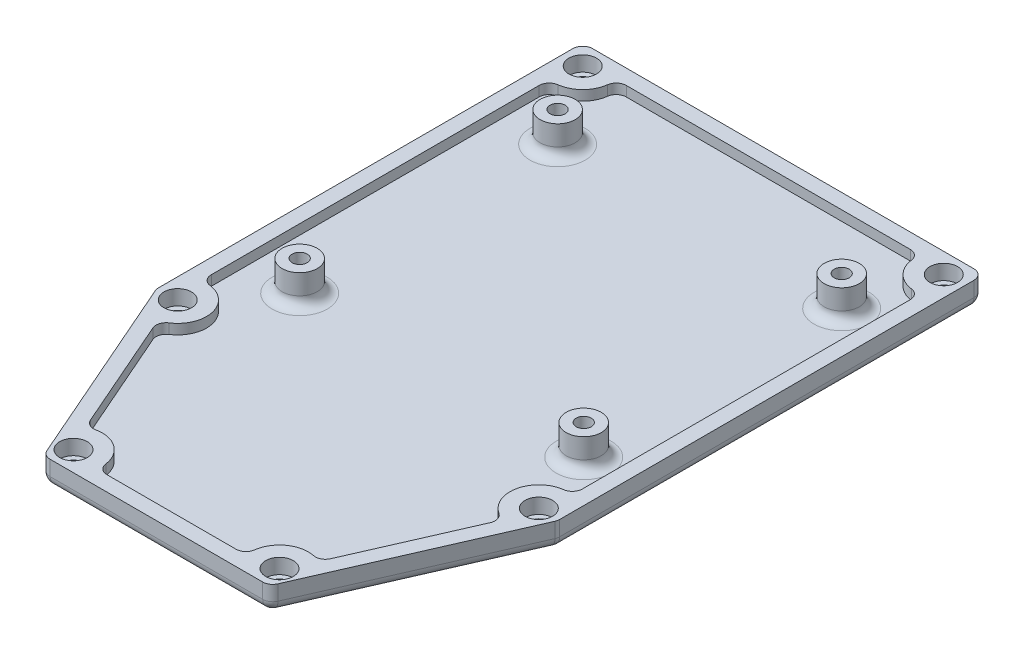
ISO-10303-21;
HEADER;
FILE_DESCRIPTION(('STEP AP214'),'2;1');
FILE_NAME('part.step','',(''),(''),'','','');
FILE_SCHEMA(('AUTOMOTIVE_DESIGN { 1 0 10303 214 1 1 1 1 }'));
ENDSEC;
DATA;
#1=APPLICATION_CONTEXT('core data for automotive mechanical design processes');
#2=APPLICATION_PROTOCOL_DEFINITION('international standard','automotive_design',2000,#1);
#3=PRODUCT_CONTEXT('',#1,'mechanical');
#4=PRODUCT('Part','Part','',(#3));
#5=PRODUCT_RELATED_PRODUCT_CATEGORY('part','',(#4));
#6=PRODUCT_DEFINITION_FORMATION('','',#4);
#7=PRODUCT_DEFINITION_CONTEXT('part definition',#1,'design');
#8=PRODUCT_DEFINITION('design','',#6,#7);
#9=PRODUCT_DEFINITION_SHAPE('','',#8);
#10=(LENGTH_UNIT() NAMED_UNIT(*) SI_UNIT(.MILLI.,.METRE.));
#11=(NAMED_UNIT(*) PLANE_ANGLE_UNIT() SI_UNIT($,.RADIAN.));
#12=(NAMED_UNIT(*) SI_UNIT($,.STERADIAN.) SOLID_ANGLE_UNIT());
#13=UNCERTAINTY_MEASURE_WITH_UNIT(LENGTH_MEASURE(1.E-05),#10,'distance_accuracy_value','');
#14=(GEOMETRIC_REPRESENTATION_CONTEXT(3) GLOBAL_UNCERTAINTY_ASSIGNED_CONTEXT((#13)) GLOBAL_UNIT_ASSIGNED_CONTEXT((#10,
#11,#12)) REPRESENTATION_CONTEXT('',''));
#15=CARTESIAN_POINT('',(0.,0.,0.));
#16=DIRECTION('',(0.,0.,1.));
#17=DIRECTION('',(1.,0.,0.));
#18=AXIS2_PLACEMENT_3D('',#15,#16,#17);
#19=CARTESIAN_POINT('',(0.,5.,0.));
#20=DIRECTION('',(0.,1.,0.));
#21=DIRECTION('',(0.,0.,1.));
#22=AXIS2_PLACEMENT_3D('',#19,#20,#21);
#23=PLANE('',#22);
#24=CARTESIAN_POINT('',(-41.96875,5.,-36.03125));
#25=DIRECTION('',(0.,1.,0.));
#26=DIRECTION('',(0.,0.,1.));
#27=AXIS2_PLACEMENT_3D('',#24,#25,#26);
#28=CIRCLE('',#27,2.75);
#29=CARTESIAN_POINT('',(-41.96875,5.,-33.28125));
#30=VERTEX_POINT('',#29);
#31=EDGE_CURVE('E538',#30,#30,#28,.T.);
#32=ORIENTED_EDGE('',*,*,#31,.F.);
#33=EDGE_LOOP('',(#32));
#34=FACE_BOUND('',#33,.T.);
#35=CARTESIAN_POINT('',(30.03125,5.,-36.03125));
#36=DIRECTION('',(0.,1.,0.));
#37=DIRECTION('',(0.,0.,1.));
#38=AXIS2_PLACEMENT_3D('',#35,#36,#37);
#39=CIRCLE('',#38,2.75);
#40=CARTESIAN_POINT('',(30.03125,5.,-33.28125));
#41=VERTEX_POINT('',#40);
#42=EDGE_CURVE('E2021',#41,#41,#39,.T.);
#43=ORIENTED_EDGE('',*,*,#42,.F.);
#44=EDGE_LOOP('',(#43));
#45=FACE_BOUND('',#44,.T.);
#46=CARTESIAN_POINT('',(30.03125,5.,44.71875));
#47=DIRECTION('',(0.,1.,0.));
#48=DIRECTION('',(0.,0.,1.));
#49=AXIS2_PLACEMENT_3D('',#46,#47,#48);
#50=CIRCLE('',#49,2.75);
#51=CARTESIAN_POINT('',(30.03125,5.,47.46875));
#52=VERTEX_POINT('',#51);
#53=EDGE_CURVE('E2037',#52,#52,#50,.T.);
#54=ORIENTED_EDGE('',*,*,#53,.F.);
#55=EDGE_LOOP('',(#54));
#56=FACE_BOUND('',#55,.T.);
#57=CARTESIAN_POINT('',(14.5732967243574,5.,80.96875));
#58=DIRECTION('',(0.,1.,0.));
#59=DIRECTION('',(0.,0.,1.));
#60=AXIS2_PLACEMENT_3D('',#57,#58,#59);
#61=CIRCLE('',#60,2.75);
#62=CARTESIAN_POINT('',(14.5732967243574,5.,83.71875));
#63=VERTEX_POINT('',#62);
#64=EDGE_CURVE('E2053',#63,#63,#61,.T.);
#65=ORIENTED_EDGE('',*,*,#64,.F.);
#66=EDGE_LOOP('',(#65));
#67=FACE_BOUND('',#66,.T.);
#68=CARTESIAN_POINT('',(-26.5067032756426,5.,80.96875));
#69=DIRECTION('',(0.,1.,0.));
#70=DIRECTION('',(0.,0.,1.));
#71=AXIS2_PLACEMENT_3D('',#68,#69,#70);
#72=CIRCLE('',#71,2.75);
#73=CARTESIAN_POINT('',(-26.5067032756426,5.,83.71875));
#74=VERTEX_POINT('',#73);
#75=EDGE_CURVE('E333',#74,#74,#72,.T.);
#76=ORIENTED_EDGE('',*,*,#75,.F.);
#77=EDGE_LOOP('',(#76));
#78=FACE_BOUND('',#77,.T.);
#79=CARTESIAN_POINT('',(-41.96875,5.,44.71875));
#80=DIRECTION('',(0.,1.,0.));
#81=DIRECTION('',(0.,0.,1.));
#82=AXIS2_PLACEMENT_3D('',#79,#80,#81);
#83=CIRCLE('',#82,2.75);
#84=CARTESIAN_POINT('',(-41.96875,5.,47.46875));
#85=VERTEX_POINT('',#84);
#86=EDGE_CURVE('E905',#85,#85,#83,.T.);
#87=ORIENTED_EDGE('',*,*,#86,.F.);
#88=EDGE_LOOP('',(#87));
#89=FACE_BOUND('',#88,.T.);
#90=DIRECTION('',(1.,0.,0.));
#91=VECTOR('',#90,1.);
#92=CARTESIAN_POINT('',(-28.46875,5.,84.96875));
#93=LINE('',#92,#91);
#94=CARTESIAN_POINT('',(-27.1607188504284,5.,84.96875));
#95=VERTEX_POINT('',#94);
#96=CARTESIAN_POINT('',(15.2232188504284,5.,84.96875));
#97=VERTEX_POINT('',#96);
#98=EDGE_CURVE('E929',#95,#97,#93,.T.);
#99=ORIENTED_EDGE('',*,*,#98,.T.);
#100=CARTESIAN_POINT('',(15.2232188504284,5.,82.96875));
#101=DIRECTION('',(0.,1.,0.));
#102=DIRECTION('',(0.,0.,1.));
#103=AXIS2_PLACEMENT_3D('',#100,#101,#102);
#104=CIRCLE('',#103,2.);
#105=CARTESIAN_POINT('',(17.0555335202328,5.,83.7703876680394));
#106=VERTEX_POINT('',#105);
#107=EDGE_CURVE('E509',#97,#106,#104,.T.);
#108=ORIENTED_EDGE('',*,*,#107,.T.);
#109=DIRECTION('',(0.400818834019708,0.,-0.916157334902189));
#110=VECTOR('',#109,1.);
#111=CARTESIAN_POINT('',(16.53125,5.,84.96875));
#112=LINE('',#111,#110);
#113=CARTESIAN_POINT('',(33.8635646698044,5.,45.3520307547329));
#114=VERTEX_POINT('',#113);
#115=EDGE_CURVE('E933',#106,#114,#112,.T.);
#116=ORIENTED_EDGE('',*,*,#115,.T.);
#117=CARTESIAN_POINT('',(32.03125,5.,44.5503930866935));
#118=DIRECTION('',(0.,1.,0.));
#119=DIRECTION('',(0.,0.,1.));
#120=AXIS2_PLACEMENT_3D('',#117,#118,#119);
#121=CIRCLE('',#120,2.);
#122=CARTESIAN_POINT('',(34.03125,5.,44.5503930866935));
#123=VERTEX_POINT('',#122);
#124=EDGE_CURVE('E506',#114,#123,#121,.T.);
#125=ORIENTED_EDGE('',*,*,#124,.T.);
#126=DIRECTION('',(0.,0.,-1.));
#127=VECTOR('',#126,1.);
#128=CARTESIAN_POINT('',(34.03125,5.,-40.03125));
#129=LINE('',#128,#127);
#130=CARTESIAN_POINT('',(34.03125,5.,-38.03125));
#131=VERTEX_POINT('',#130);
#132=EDGE_CURVE('E937',#123,#131,#129,.T.);
#133=ORIENTED_EDGE('',*,*,#132,.T.);
#134=CARTESIAN_POINT('',(32.03125,5.,-38.03125));
#135=DIRECTION('',(0.,1.,0.));
#136=DIRECTION('',(0.,0.,1.));
#137=AXIS2_PLACEMENT_3D('',#134,#135,#136);
#138=CIRCLE('',#137,2.);
#139=CARTESIAN_POINT('',(32.03125,5.,-40.03125));
#140=VERTEX_POINT('',#139);
#141=EDGE_CURVE('E503',#131,#140,#138,.T.);
#142=ORIENTED_EDGE('',*,*,#141,.T.);
#143=DIRECTION('',(-1.,0.,0.));
#144=VECTOR('',#143,1.);
#145=CARTESIAN_POINT('',(-45.96875,5.,-40.03125));
#146=LINE('',#145,#144);
#147=CARTESIAN_POINT('',(-43.96875,5.,-40.03125));
#148=VERTEX_POINT('',#147);
#149=EDGE_CURVE('E450',#140,#148,#146,.T.);
#150=ORIENTED_EDGE('',*,*,#149,.T.);
#151=CARTESIAN_POINT('',(-43.96875,5.,-38.03125));
#152=DIRECTION('',(0.,1.,0.));
#153=DIRECTION('',(0.,0.,1.));
#154=AXIS2_PLACEMENT_3D('',#151,#152,#153);
#155=CIRCLE('',#154,2.);
#156=CARTESIAN_POINT('',(-45.96875,5.,-38.03125));
#157=VERTEX_POINT('',#156);
#158=EDGE_CURVE('E500',#148,#157,#155,.T.);
#159=ORIENTED_EDGE('',*,*,#158,.T.);
#160=DIRECTION('',(0.,0.,1.));
#161=VECTOR('',#160,1.);
#162=CARTESIAN_POINT('',(-45.96875,5.,-40.03125));
#163=LINE('',#162,#161);
#164=CARTESIAN_POINT('',(-45.96875,5.,44.5503930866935));
#165=VERTEX_POINT('',#164);
#166=EDGE_CURVE('E921',#157,#165,#163,.T.);
#167=ORIENTED_EDGE('',*,*,#166,.T.);
#168=CARTESIAN_POINT('',(-43.96875,5.,44.5503930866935));
#169=DIRECTION('',(0.,1.,0.));
#170=DIRECTION('',(0.,0.,1.));
#171=AXIS2_PLACEMENT_3D('',#168,#169,#170);
#172=CIRCLE('',#171,2.);
#173=CARTESIAN_POINT('',(-45.8010646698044,5.,45.3520307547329));
#174=VERTEX_POINT('',#173);
#175=EDGE_CURVE('E494',#165,#174,#172,.T.);
#176=ORIENTED_EDGE('',*,*,#175,.T.);
#177=DIRECTION('',(0.400818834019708,0.,0.916157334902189));
#178=VECTOR('',#177,1.);
#179=CARTESIAN_POINT('',(-28.46875,5.,84.96875));
#180=LINE('',#179,#178);
#181=CARTESIAN_POINT('',(-28.9930335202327,5.,83.7703876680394));
#182=VERTEX_POINT('',#181);
#183=EDGE_CURVE('E925',#174,#182,#180,.T.);
#184=ORIENTED_EDGE('',*,*,#183,.T.);
#185=CARTESIAN_POINT('',(-27.1607188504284,5.,82.96875));
#186=DIRECTION('',(0.,1.,0.));
#187=DIRECTION('',(0.,0.,1.));
#188=AXIS2_PLACEMENT_3D('',#185,#186,#187);
#189=CIRCLE('',#188,2.);
#190=EDGE_CURVE('E497',#182,#95,#189,.T.);
#191=ORIENTED_EDGE('',*,*,#190,.T.);
#192=EDGE_LOOP('',(#99,#108,#116,#125,#133,#142,#150,#159,#167,#176,#184,#191));
#193=FACE_BOUND('',#192,.T.);
#194=DIRECTION('',(0.400818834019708,0.,0.916157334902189));
#195=VECTOR('',#194,1.);
#196=CARTESIAN_POINT('',(-25.7202779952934,5.,83.7662934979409));
#197=LINE('',#196,#195);
#198=CARTESIAN_POINT('',(-39.6028179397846,5.,52.0347736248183));
#199=VERTEX_POINT('',#198);
#200=CARTESIAN_POINT('',(-29.9134109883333,5.,74.1819895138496));
#201=VERTEX_POINT('',#200);
#202=EDGE_CURVE('E1943',#199,#201,#197,.T.);
#203=ORIENTED_EDGE('',*,*,#202,.F.);
#204=CARTESIAN_POINT('',(-37.7705032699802,5.,51.2331359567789));
#205=DIRECTION('',(0.,1.,0.));
#206=DIRECTION('',(0.,0.,1.));
#207=AXIS2_PLACEMENT_3D('',#204,#205,#206);
#208=CIRCLE('',#207,2.);
#209=CARTESIAN_POINT('',(-38.853921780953,5.,49.552004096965));
#210=VERTEX_POINT('',#209);
#211=EDGE_CURVE('E697',#199,#210,#208,.F.);
#212=ORIENTED_EDGE('',*,*,#211,.T.);
#213=CARTESIAN_POINT('',(-41.96875,5.,44.71875));
#214=DIRECTION('',(0.,1.,0.));
#215=DIRECTION('',(0.,0.,1.));
#216=AXIS2_PLACEMENT_3D('',#213,#214,#215);
#217=CIRCLE('',#216,5.75);
#218=CARTESIAN_POINT('',(-41.226814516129,5.,39.0168177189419));
#219=VERTEX_POINT('',#218);
#220=EDGE_CURVE('E1944',#210,#219,#217,.T.);
#221=ORIENTED_EDGE('',*,*,#220,.T.);
#222=CARTESIAN_POINT('',(-40.96875,5.,37.0335369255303));
#223=DIRECTION('',(0.,1.,0.));
#224=DIRECTION('',(0.,0.,1.));
#225=AXIS2_PLACEMENT_3D('',#222,#223,#224);
#226=CIRCLE('',#225,2.);
#227=CARTESIAN_POINT('',(-42.96875,5.,37.0335369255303));
#228=VERTEX_POINT('',#227);
#229=EDGE_CURVE('E61',#219,#228,#226,.F.);
#230=ORIENTED_EDGE('',*,*,#229,.T.);
#231=DIRECTION('',(0.,0.,1.));
#232=VECTOR('',#231,1.);
#233=CARTESIAN_POINT('',(-42.96875,5.,-40.03125));
#234=LINE('',#233,#232);
#235=CARTESIAN_POINT('',(-42.96875,5.,-28.3460369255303));
#236=VERTEX_POINT('',#235);
#237=EDGE_CURVE('E1940',#236,#228,#234,.T.);
#238=ORIENTED_EDGE('',*,*,#237,.F.);
#239=CARTESIAN_POINT('',(-40.96875,5.,-28.3460369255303));
#240=DIRECTION('',(0.,1.,0.));
#241=DIRECTION('',(0.,0.,1.));
#242=AXIS2_PLACEMENT_3D('',#239,#240,#241);
#243=CIRCLE('',#242,2.);
#244=CARTESIAN_POINT('',(-41.226814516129,5.,-30.3293177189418));
#245=VERTEX_POINT('',#244);
#246=EDGE_CURVE('E702',#236,#245,#243,.F.);
#247=ORIENTED_EDGE('',*,*,#246,.T.);
#248=CARTESIAN_POINT('',(-41.96875,5.,-36.03125));
#249=DIRECTION('',(0.,1.,0.));
#250=DIRECTION('',(0.,0.,1.));
#251=AXIS2_PLACEMENT_3D('',#248,#249,#250);
#252=CIRCLE('',#251,5.75);
#253=CARTESIAN_POINT('',(-36.2668177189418,5.,-35.289314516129));
#254=VERTEX_POINT('',#253);
#255=EDGE_CURVE('E1914',#245,#254,#252,.T.);
#256=ORIENTED_EDGE('',*,*,#255,.T.);
#257=CARTESIAN_POINT('',(-34.2835369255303,5.,-35.03125));
#258=DIRECTION('',(0.,1.,0.));
#259=DIRECTION('',(0.,0.,1.));
#260=AXIS2_PLACEMENT_3D('',#257,#258,#259);
#261=CIRCLE('',#260,2.);
#262=CARTESIAN_POINT('',(-34.2835369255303,5.,-37.03125));
#263=VERTEX_POINT('',#262);
#264=EDGE_CURVE('E673',#254,#263,#261,.F.);
#265=ORIENTED_EDGE('',*,*,#264,.T.);
#266=DIRECTION('',(-1.,0.,0.));
#267=VECTOR('',#266,1.);
#268=CARTESIAN_POINT('',(-45.96875,5.,-37.03125));
#269=LINE('',#268,#267);
#270=CARTESIAN_POINT('',(22.3460369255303,5.,-37.03125));
#271=VERTEX_POINT('',#270);
#272=EDGE_CURVE('E1931',#271,#263,#269,.T.);
#273=ORIENTED_EDGE('',*,*,#272,.F.);
#274=CARTESIAN_POINT('',(22.3460369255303,5.,-35.03125));
#275=DIRECTION('',(0.,1.,0.));
#276=DIRECTION('',(0.,0.,1.));
#277=AXIS2_PLACEMENT_3D('',#274,#275,#276);
#278=CIRCLE('',#277,2.);
#279=CARTESIAN_POINT('',(24.3293177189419,5.,-35.289314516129));
#280=VERTEX_POINT('',#279);
#281=EDGE_CURVE('E670',#271,#280,#278,.F.);
#282=ORIENTED_EDGE('',*,*,#281,.T.);
#283=CARTESIAN_POINT('',(30.03125,5.,-36.03125));
#284=DIRECTION('',(0.,1.,0.));
#285=DIRECTION('',(0.,0.,1.));
#286=AXIS2_PLACEMENT_3D('',#283,#284,#285);
#287=CIRCLE('',#286,5.75);
#288=CARTESIAN_POINT('',(29.289314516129,5.,-30.3293177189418));
#289=VERTEX_POINT('',#288);
#290=EDGE_CURVE('E1977',#280,#289,#287,.T.);
#291=ORIENTED_EDGE('',*,*,#290,.T.);
#292=CARTESIAN_POINT('',(29.03125,5.,-28.3460369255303));
#293=DIRECTION('',(0.,1.,0.));
#294=DIRECTION('',(0.,0.,1.));
#295=AXIS2_PLACEMENT_3D('',#292,#293,#294);
#296=CIRCLE('',#295,2.);
#297=CARTESIAN_POINT('',(31.03125,5.,-28.3460369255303));
#298=VERTEX_POINT('',#297);
#299=EDGE_CURVE('E694',#289,#298,#296,.F.);
#300=ORIENTED_EDGE('',*,*,#299,.T.);
#301=DIRECTION('',(0.,0.,-1.));
#302=VECTOR('',#301,1.);
#303=CARTESIAN_POINT('',(31.03125,5.,-40.03125));
#304=LINE('',#303,#302);
#305=CARTESIAN_POINT('',(31.03125,5.,37.0335369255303));
#306=VERTEX_POINT('',#305);
#307=EDGE_CURVE('E1956',#306,#298,#304,.T.);
#308=ORIENTED_EDGE('',*,*,#307,.F.);
#309=CARTESIAN_POINT('',(29.03125,5.,37.0335369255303));
#310=DIRECTION('',(0.,1.,0.));
#311=DIRECTION('',(0.,0.,1.));
#312=AXIS2_PLACEMENT_3D('',#309,#310,#311);
#313=CIRCLE('',#312,2.);
#314=CARTESIAN_POINT('',(29.289314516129,5.,39.0168177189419));
#315=VERTEX_POINT('',#314);
#316=EDGE_CURVE('E688',#306,#315,#313,.F.);
#317=ORIENTED_EDGE('',*,*,#316,.T.);
#318=CARTESIAN_POINT('',(30.03125,5.,44.71875));
#319=DIRECTION('',(0.,1.,0.));
#320=DIRECTION('',(0.,0.,1.));
#321=AXIS2_PLACEMENT_3D('',#318,#319,#320);
#322=CIRCLE('',#321,5.75);
#323=CARTESIAN_POINT('',(26.9164217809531,5.,49.552004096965));
#324=VERTEX_POINT('',#323);
#325=EDGE_CURVE('E1973',#315,#324,#322,.T.);
#326=ORIENTED_EDGE('',*,*,#325,.T.);
#327=CARTESIAN_POINT('',(25.8330032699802,5.,51.2331359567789));
#328=DIRECTION('',(0.,1.,0.));
#329=DIRECTION('',(0.,0.,1.));
#330=AXIS2_PLACEMENT_3D('',#327,#328,#329);
#331=CIRCLE('',#330,2.);
#332=CARTESIAN_POINT('',(27.6653179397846,5.,52.0347736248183));
#333=VERTEX_POINT('',#332);
#334=EDGE_CURVE('E691',#324,#333,#331,.F.);
#335=ORIENTED_EDGE('',*,*,#334,.T.);
#336=DIRECTION('',(0.400818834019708,0.,-0.916157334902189));
#337=VECTOR('',#336,1.);
#338=CARTESIAN_POINT('',(13.7827779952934,5.,83.7662934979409));
#339=LINE('',#338,#337);
#340=CARTESIAN_POINT('',(17.9762512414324,5.,74.1812117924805));
#341=VERTEX_POINT('',#340);
#342=EDGE_CURVE('E1952',#341,#333,#339,.T.);
#343=ORIENTED_EDGE('',*,*,#342,.F.);
#344=CARTESIAN_POINT('',(16.143936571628,5.,73.3795741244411));
#345=DIRECTION('',(0.,1.,0.));
#346=DIRECTION('',(0.,0.,1.));
#347=AXIS2_PLACEMENT_3D('',#344,#345,#346);
#348=CIRCLE('',#347,2.);
#349=CARTESIAN_POINT('',(15.7386101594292,5.,75.3380711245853));
#350=VERTEX_POINT('',#349);
#351=EDGE_CURVE('E685',#341,#350,#348,.F.);
#352=ORIENTED_EDGE('',*,*,#351,.T.);
#353=CARTESIAN_POINT('',(14.5732967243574,5.,80.96875));
#354=DIRECTION('',(0.,1.,0.));
#355=DIRECTION('',(0.,0.,1.));
#356=AXIS2_PLACEMENT_3D('',#353,#354,#355);
#357=CIRCLE('',#356,5.75);
#358=CARTESIAN_POINT('',(8.87136444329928,5.,80.226814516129));
#359=VERTEX_POINT('',#358);
#360=EDGE_CURVE('E1969',#350,#359,#357,.T.);
#361=ORIENTED_EDGE('',*,*,#360,.T.);
#362=CARTESIAN_POINT('',(6.88808364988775,5.,79.96875));
#363=DIRECTION('',(0.,1.,0.));
#364=DIRECTION('',(0.,0.,1.));
#365=AXIS2_PLACEMENT_3D('',#362,#363,#364);
#366=CIRCLE('',#365,2.);
#367=CARTESIAN_POINT('',(6.88808364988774,5.,81.96875));
#368=VERTEX_POINT('',#367);
#369=EDGE_CURVE('E682',#359,#368,#366,.F.);
#370=ORIENTED_EDGE('',*,*,#369,.T.);
#371=DIRECTION('',(1.,0.,0.));
#372=VECTOR('',#371,1.);
#373=CARTESIAN_POINT('',(-28.46875,5.,81.96875));
#374=LINE('',#373,#372);
#375=CARTESIAN_POINT('',(-18.8214902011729,5.,81.96875));
#376=VERTEX_POINT('',#375);
#377=EDGE_CURVE('E1948',#376,#368,#374,.T.);
#378=ORIENTED_EDGE('',*,*,#377,.F.);
#379=CARTESIAN_POINT('',(-18.8214902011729,5.,79.96875));
#380=DIRECTION('',(0.,1.,0.));
#381=DIRECTION('',(0.,0.,1.));
#382=AXIS2_PLACEMENT_3D('',#379,#380,#381);
#383=CIRCLE('',#382,2.);
#384=CARTESIAN_POINT('',(-20.8047709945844,5.,80.226814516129));
#385=VERTEX_POINT('',#384);
#386=EDGE_CURVE('E676',#376,#385,#383,.F.);
#387=ORIENTED_EDGE('',*,*,#386,.T.);
#388=CARTESIAN_POINT('',(-26.5067032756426,5.,80.96875));
#389=DIRECTION('',(0.,1.,0.));
#390=DIRECTION('',(0.,0.,1.));
#391=AXIS2_PLACEMENT_3D('',#388,#389,#390);
#392=CIRCLE('',#391,5.75);
#393=CARTESIAN_POINT('',(-27.6748013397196,5.,75.3386481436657));
#394=VERTEX_POINT('',#393);
#395=EDGE_CURVE('E1965',#385,#394,#392,.T.);
#396=ORIENTED_EDGE('',*,*,#395,.T.);
#397=CARTESIAN_POINT('',(-28.081096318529,5.,73.3803518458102));
#398=DIRECTION('',(0.,1.,0.));
#399=DIRECTION('',(0.,0.,1.));
#400=AXIS2_PLACEMENT_3D('',#397,#398,#399);
#401=CIRCLE('',#400,2.);
#402=EDGE_CURVE('E679',#394,#201,#401,.F.);
#403=ORIENTED_EDGE('',*,*,#402,.T.);
#404=EDGE_LOOP('',(#203,#212,#221,#230,#238,#247,#256,#265,#273,#282,#291,#300,#308,#317,#326,
#335,#343,#352,#361,#370,#378,#387,#396,#403));
#405=FACE_BOUND('',#404,.T.);
#406=ADVANCED_FACE('F45',(#34,#45,#56,#67,#78,#89,#193,#405),#23,.T.);
#407=CARTESIAN_POINT('',(-45.96875,5.,-40.03125));
#408=DIRECTION('',(1.,0.,0.));
#409=DIRECTION('',(0.,0.,-1.));
#410=AXIS2_PLACEMENT_3D('',#407,#408,#409);
#411=PLANE('',#410);
#412=ORIENTED_EDGE('',*,*,#166,.F.);
#413=DIRECTION('',(0.,-1.,0.));
#414=VECTOR('',#413,1.);
#415=CARTESIAN_POINT('',(-45.96875,5.,-38.03125));
#416=LINE('',#415,#414);
#417=CARTESIAN_POINT('',(-45.96875,2.,-38.03125));
#418=VERTEX_POINT('',#417);
#419=EDGE_CURVE('E459',#157,#418,#416,.T.);
#420=ORIENTED_EDGE('',*,*,#419,.T.);
#421=DIRECTION('',(0.,0.,1.));
#422=VECTOR('',#421,1.);
#423=CARTESIAN_POINT('',(-45.96875,2.,-40.03125));
#424=LINE('',#423,#422);
#425=CARTESIAN_POINT('',(-45.96875,2.,44.5503930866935));
#426=VERTEX_POINT('',#425);
#427=EDGE_CURVE('E440',#418,#426,#424,.T.);
#428=ORIENTED_EDGE('',*,*,#427,.T.);
#429=DIRECTION('',(0.,-1.,0.));
#430=VECTOR('',#429,1.);
#431=CARTESIAN_POINT('',(-45.96875,5.,44.5503930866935));
#432=LINE('',#431,#430);
#433=EDGE_CURVE('E523',#426,#165,#432,.F.);
#434=ORIENTED_EDGE('',*,*,#433,.T.);
#435=EDGE_LOOP('',(#412,#420,#428,#434));
#436=FACE_BOUND('',#435,.T.);
#437=ADVANCED_FACE('F396',(#436),#411,.F.);
#438=CARTESIAN_POINT('',(-28.46875,5.,84.96875));
#439=DIRECTION('',(0.916157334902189,0.,-0.400818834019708));
#440=DIRECTION('',(-0.400818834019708,0.,-0.916157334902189));
#441=AXIS2_PLACEMENT_3D('',#438,#439,#440);
#442=PLANE('',#441);
#443=DIRECTION('',(0.400818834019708,0.,0.916157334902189));
#444=VECTOR('',#443,1.);
#445=CARTESIAN_POINT('',(-28.46875,2.,84.96875));
#446=LINE('',#445,#444);
#447=CARTESIAN_POINT('',(-45.8010646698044,2.,45.3520307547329));
#448=VERTEX_POINT('',#447);
#449=CARTESIAN_POINT('',(-28.9930335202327,2.,83.7703876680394));
#450=VERTEX_POINT('',#449);
#451=EDGE_CURVE('E355',#448,#450,#446,.T.);
#452=ORIENTED_EDGE('',*,*,#451,.T.);
#453=DIRECTION('',(0.,-1.,0.));
#454=VECTOR('',#453,1.);
#455=CARTESIAN_POINT('',(-28.9930335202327,5.,83.7703876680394));
#456=LINE('',#455,#454);
#457=EDGE_CURVE('E531',#450,#182,#456,.F.);
#458=ORIENTED_EDGE('',*,*,#457,.T.);
#459=ORIENTED_EDGE('',*,*,#183,.F.);
#460=DIRECTION('',(0.,-1.,0.));
#461=VECTOR('',#460,1.);
#462=CARTESIAN_POINT('',(-45.8010646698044,5.,45.3520307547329));
#463=LINE('',#462,#461);
#464=EDGE_CURVE('E528',#174,#448,#463,.T.);
#465=ORIENTED_EDGE('',*,*,#464,.T.);
#466=EDGE_LOOP('',(#452,#458,#459,#465));
#467=FACE_BOUND('',#466,.T.);
#468=ADVANCED_FACE('F416',(#467),#442,.F.);
#469=CARTESIAN_POINT('',(-28.46875,5.,84.96875));
#470=DIRECTION('',(0.,0.,-1.));
#471=DIRECTION('',(-1.,0.,0.));
#472=AXIS2_PLACEMENT_3D('',#469,#470,#471);
#473=PLANE('',#472);
#474=DIRECTION('',(1.,0.,0.));
#475=VECTOR('',#474,1.);
#476=CARTESIAN_POINT('',(-28.46875,2.,84.96875));
#477=LINE('',#476,#475);
#478=CARTESIAN_POINT('',(-27.1607188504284,2.,84.96875));
#479=VERTEX_POINT('',#478);
#480=CARTESIAN_POINT('',(15.2232188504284,2.,84.96875));
#481=VERTEX_POINT('',#480);
#482=EDGE_CURVE('E368',#479,#481,#477,.T.);
#483=ORIENTED_EDGE('',*,*,#482,.T.);
#484=DIRECTION('',(0.,-1.,0.));
#485=VECTOR('',#484,1.);
#486=CARTESIAN_POINT('',(15.2232188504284,5.,84.96875));
#487=LINE('',#486,#485);
#488=EDGE_CURVE('E491',#481,#97,#487,.F.);
#489=ORIENTED_EDGE('',*,*,#488,.T.);
#490=ORIENTED_EDGE('',*,*,#98,.F.);
#491=DIRECTION('',(0.,-1.,0.));
#492=VECTOR('',#491,1.);
#493=CARTESIAN_POINT('',(-27.1607188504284,5.,84.96875));
#494=LINE('',#493,#492);
#495=EDGE_CURVE('E488',#95,#479,#494,.T.);
#496=ORIENTED_EDGE('',*,*,#495,.T.);
#497=EDGE_LOOP('',(#483,#489,#490,#496));
#498=FACE_BOUND('',#497,.T.);
#499=ADVANCED_FACE('F412',(#498),#473,.F.);
#500=CARTESIAN_POINT('',(16.53125,5.,84.96875));
#501=DIRECTION('',(-0.916157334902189,0.,-0.400818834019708));
#502=DIRECTION('',(-0.400818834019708,0.,0.916157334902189));
#503=AXIS2_PLACEMENT_3D('',#500,#501,#502);
#504=PLANE('',#503);
#505=ORIENTED_EDGE('',*,*,#115,.F.);
#506=DIRECTION('',(0.,-1.,0.));
#507=VECTOR('',#506,1.);
#508=CARTESIAN_POINT('',(17.0555335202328,5.,83.7703876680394));
#509=LINE('',#508,#507);
#510=CARTESIAN_POINT('',(17.0555335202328,2.,83.7703876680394));
#511=VERTEX_POINT('',#510);
#512=EDGE_CURVE('E485',#106,#511,#509,.T.);
#513=ORIENTED_EDGE('',*,*,#512,.T.);
#514=DIRECTION('',(0.400818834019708,0.,-0.916157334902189));
#515=VECTOR('',#514,1.);
#516=CARTESIAN_POINT('',(16.53125,2.,84.96875));
#517=LINE('',#516,#515);
#518=CARTESIAN_POINT('',(33.8635646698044,2.,45.3520307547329));
#519=VERTEX_POINT('',#518);
#520=EDGE_CURVE('E321',#511,#519,#517,.T.);
#521=ORIENTED_EDGE('',*,*,#520,.T.);
#522=DIRECTION('',(0.,-1.,0.));
#523=VECTOR('',#522,1.);
#524=CARTESIAN_POINT('',(33.8635646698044,5.,45.3520307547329));
#525=LINE('',#524,#523);
#526=EDGE_CURVE('E482',#519,#114,#525,.F.);
#527=ORIENTED_EDGE('',*,*,#526,.T.);
#528=EDGE_LOOP('',(#505,#513,#521,#527));
#529=FACE_BOUND('',#528,.T.);
#530=ADVANCED_FACE('F408',(#529),#504,.F.);
#531=CARTESIAN_POINT('',(34.03125,5.,-40.03125));
#532=DIRECTION('',(-1.,0.,0.));
#533=DIRECTION('',(0.,0.,1.));
#534=AXIS2_PLACEMENT_3D('',#531,#532,#533);
#535=PLANE('',#534);
#536=ORIENTED_EDGE('',*,*,#132,.F.);
#537=DIRECTION('',(0.,-1.,0.));
#538=VECTOR('',#537,1.);
#539=CARTESIAN_POINT('',(34.03125,5.,44.5503930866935));
#540=LINE('',#539,#538);
#541=CARTESIAN_POINT('',(34.03125,2.,44.5503930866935));
#542=VERTEX_POINT('',#541);
#543=EDGE_CURVE('E515',#123,#542,#540,.T.);
#544=ORIENTED_EDGE('',*,*,#543,.T.);
#545=DIRECTION('',(0.,0.,-1.));
#546=VECTOR('',#545,1.);
#547=CARTESIAN_POINT('',(34.03125,2.,-40.03125));
#548=LINE('',#547,#546);
#549=CARTESIAN_POINT('',(34.03125,2.,-38.03125));
#550=VERTEX_POINT('',#549);
#551=EDGE_CURVE('E320',#542,#550,#548,.T.);
#552=ORIENTED_EDGE('',*,*,#551,.T.);
#553=DIRECTION('',(0.,-1.,0.));
#554=VECTOR('',#553,1.);
#555=CARTESIAN_POINT('',(34.03125,5.,-38.03125));
#556=LINE('',#555,#554);
#557=EDGE_CURVE('E512',#550,#131,#556,.F.);
#558=ORIENTED_EDGE('',*,*,#557,.T.);
#559=EDGE_LOOP('',(#536,#544,#552,#558));
#560=FACE_BOUND('',#559,.T.);
#561=ADVANCED_FACE('F404',(#560),#535,.F.);
#562=CARTESIAN_POINT('',(-45.96875,5.,-40.03125));
#563=DIRECTION('',(0.,0.,1.));
#564=DIRECTION('',(1.,0.,0.));
#565=AXIS2_PLACEMENT_3D('',#562,#563,#564);
#566=PLANE('',#565);
#567=ORIENTED_EDGE('',*,*,#149,.F.);
#568=DIRECTION('',(0.,-1.,0.));
#569=VECTOR('',#568,1.);
#570=CARTESIAN_POINT('',(32.03125,5.,-40.03125));
#571=LINE('',#570,#569);
#572=CARTESIAN_POINT('',(32.03125,2.,-40.03125));
#573=VERTEX_POINT('',#572);
#574=EDGE_CURVE('E520',#140,#573,#571,.T.);
#575=ORIENTED_EDGE('',*,*,#574,.T.);
#576=DIRECTION('',(-1.,0.,0.));
#577=VECTOR('',#576,1.);
#578=CARTESIAN_POINT('',(-45.96875,2.,-40.03125));
#579=LINE('',#578,#577);
#580=CARTESIAN_POINT('',(-43.96875,2.,-40.03125));
#581=VERTEX_POINT('',#580);
#582=EDGE_CURVE('E995',#573,#581,#579,.T.);
#583=ORIENTED_EDGE('',*,*,#582,.T.);
#584=DIRECTION('',(0.,-1.,0.));
#585=VECTOR('',#584,1.);
#586=CARTESIAN_POINT('',(-43.96875,5.,-40.03125));
#587=LINE('',#586,#585);
#588=EDGE_CURVE('E460',#581,#148,#587,.F.);
#589=ORIENTED_EDGE('',*,*,#588,.T.);
#590=EDGE_LOOP('',(#567,#575,#583,#589));
#591=FACE_BOUND('',#590,.T.);
#592=ADVANCED_FACE('F400',(#591),#566,.F.);
#593=CARTESIAN_POINT('',(0.,0.,0.));
#594=DIRECTION('',(0.,1.,0.));
#595=DIRECTION('',(0.,0.,1.));
#596=AXIS2_PLACEMENT_3D('',#593,#594,#595);
#597=PLANE('',#596);
#598=CARTESIAN_POINT('',(-41.96875,0.,-36.03125));
#599=DIRECTION('',(0.,1.,0.));
#600=DIRECTION('',(0.,0.,1.));
#601=AXIS2_PLACEMENT_3D('',#598,#599,#600);
#602=CIRCLE('',#601,1.7);
#603=CARTESIAN_POINT('',(-41.96875,0.,-34.33125));
#604=VERTEX_POINT('',#603);
#605=EDGE_CURVE('E2017',#604,#604,#602,.T.);
#606=ORIENTED_EDGE('',*,*,#605,.T.);
#607=EDGE_LOOP('',(#606));
#608=FACE_BOUND('',#607,.T.);
#609=CARTESIAN_POINT('',(30.03125,0.,-36.03125));
#610=DIRECTION('',(0.,1.,0.));
#611=DIRECTION('',(0.,0.,1.));
#612=AXIS2_PLACEMENT_3D('',#609,#610,#611);
#613=CIRCLE('',#612,1.7);
#614=CARTESIAN_POINT('',(30.03125,0.,-34.33125));
#615=VERTEX_POINT('',#614);
#616=EDGE_CURVE('E2033',#615,#615,#613,.T.);
#617=ORIENTED_EDGE('',*,*,#616,.T.);
#618=EDGE_LOOP('',(#617));
#619=FACE_BOUND('',#618,.T.);
#620=CARTESIAN_POINT('',(30.03125,0.,44.71875));
#621=DIRECTION('',(0.,1.,0.));
#622=DIRECTION('',(0.,0.,1.));
#623=AXIS2_PLACEMENT_3D('',#620,#621,#622);
#624=CIRCLE('',#623,1.7);
#625=CARTESIAN_POINT('',(30.03125,0.,46.41875));
#626=VERTEX_POINT('',#625);
#627=EDGE_CURVE('E2049',#626,#626,#624,.T.);
#628=ORIENTED_EDGE('',*,*,#627,.T.);
#629=EDGE_LOOP('',(#628));
#630=FACE_BOUND('',#629,.T.);
#631=DIRECTION('',(1.,0.,0.));
#632=VECTOR('',#631,1.);
#633=CARTESIAN_POINT('',(0.,0.,82.96875));
#634=LINE('',#633,#632);
#635=CARTESIAN_POINT('',(15.2232188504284,0.,82.96875));
#636=VERTEX_POINT('',#635);
#637=CARTESIAN_POINT('',(-27.1607188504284,0.,82.96875));
#638=VERTEX_POINT('',#637);
#639=EDGE_CURVE('E341',#636,#638,#634,.F.);
#640=ORIENTED_EDGE('',*,*,#639,.T.);
#641=DIRECTION('',(0.400818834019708,0.,0.916157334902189));
#642=VECTOR('',#641,1.);
#643=CARTESIAN_POINT('',(-53.264406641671,0.,23.3031779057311));
#644=LINE('',#643,#642);
#645=CARTESIAN_POINT('',(-27.4040149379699,0.,82.4126446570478));
#646=VERTEX_POINT('',#645);
#647=EDGE_CURVE('E346',#638,#646,#644,.F.);
#648=ORIENTED_EDGE('',*,*,#647,.T.);
#649=CARTESIAN_POINT('',(-26.5067032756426,0.,80.96875));
#650=DIRECTION('',(0.,1.,0.));
#651=DIRECTION('',(0.,0.,1.));
#652=AXIS2_PLACEMENT_3D('',#649,#650,#651);
#653=CIRCLE('',#652,1.7);
#654=CARTESIAN_POINT('',(-28.1761325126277,0.,80.6478044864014));
#655=VERTEX_POINT('',#654);
#656=EDGE_CURVE('E901',#646,#655,#653,.T.);
#657=ORIENTED_EDGE('',*,*,#656,.T.);
#658=DIRECTION('',(0.400818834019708,0.,0.916157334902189));
#659=VECTOR('',#658,1.);
#660=CARTESIAN_POINT('',(-53.264406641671,0.,23.3031779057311));
#661=LINE('',#660,#659);
#662=CARTESIAN_POINT('',(-43.96875,0.,44.5503930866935));
#663=VERTEX_POINT('',#662);
#664=EDGE_CURVE('E342',#655,#663,#661,.F.);
#665=ORIENTED_EDGE('',*,*,#664,.T.);
#666=DIRECTION('',(0.,0.,1.));
#667=VECTOR('',#666,1.);
#668=CARTESIAN_POINT('',(-43.96875,0.,0.));
#669=LINE('',#668,#667);
#670=CARTESIAN_POINT('',(-43.96875,0.,-38.03125));
#671=VERTEX_POINT('',#670);
#672=EDGE_CURVE('E349',#663,#671,#669,.F.);
#673=ORIENTED_EDGE('',*,*,#672,.T.);
#674=DIRECTION('',(-1.,0.,0.));
#675=VECTOR('',#674,1.);
#676=CARTESIAN_POINT('',(0.,0.,-38.03125));
#677=LINE('',#676,#675);
#678=CARTESIAN_POINT('',(32.03125,0.,-38.03125));
#679=VERTEX_POINT('',#678);
#680=EDGE_CURVE('E449',#671,#679,#677,.F.);
#681=ORIENTED_EDGE('',*,*,#680,.T.);
#682=DIRECTION('',(0.,0.,-1.));
#683=VECTOR('',#682,1.);
#684=CARTESIAN_POINT('',(32.03125,0.,0.));
#685=LINE('',#684,#683);
#686=CARTESIAN_POINT('',(32.03125,0.,44.5503930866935));
#687=VERTEX_POINT('',#686);
#688=EDGE_CURVE('E947',#679,#687,#685,.F.);
#689=ORIENTED_EDGE('',*,*,#688,.T.);
#690=DIRECTION('',(0.400818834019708,0.,-0.916157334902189));
#691=VECTOR('',#690,1.);
#692=CARTESIAN_POINT('',(43.2447345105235,0.,18.919571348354));
#693=LINE('',#692,#691);
#694=CARTESIAN_POINT('',(16.2414672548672,0.,80.6413250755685));
#695=VERTEX_POINT('',#694);
#696=EDGE_CURVE('E331',#687,#695,#693,.F.);
#697=ORIENTED_EDGE('',*,*,#696,.T.);
#698=CARTESIAN_POINT('',(14.5732967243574,0.,80.96875));
#699=DIRECTION('',(0.,1.,0.));
#700=DIRECTION('',(0.,0.,1.));
#701=AXIS2_PLACEMENT_3D('',#698,#699,#700);
#702=CIRCLE('',#701,1.7);
#703=CARTESIAN_POINT('',(15.4649954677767,0.,82.4161177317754));
#704=VERTEX_POINT('',#703);
#705=EDGE_CURVE('E315',#695,#704,#702,.T.);
#706=ORIENTED_EDGE('',*,*,#705,.T.);
#707=DIRECTION('',(0.400818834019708,0.,-0.916157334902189));
#708=VECTOR('',#707,1.);
#709=CARTESIAN_POINT('',(43.2447345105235,0.,18.919571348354));
#710=LINE('',#709,#708);
#711=EDGE_CURVE('E328',#704,#636,#710,.F.);
#712=ORIENTED_EDGE('',*,*,#711,.T.);
#713=EDGE_LOOP('',(#640,#648,#657,#665,#673,#681,#689,#697,#706,#712));
#714=FACE_BOUND('',#713,.T.);
#715=CARTESIAN_POINT('',(-41.96875,0.,44.71875));
#716=DIRECTION('',(0.,1.,0.));
#717=DIRECTION('',(0.,0.,1.));
#718=AXIS2_PLACEMENT_3D('',#715,#716,#717);
#719=CIRCLE('',#718,1.7);
#720=CARTESIAN_POINT('',(-41.96875,0.,46.41875));
#721=VERTEX_POINT('',#720);
#722=EDGE_CURVE('E917',#721,#721,#719,.T.);
#723=ORIENTED_EDGE('',*,*,#722,.T.);
#724=EDGE_LOOP('',(#723));
#725=FACE_BOUND('',#724,.T.);
#726=ADVANCED_FACE('F326',(#608,#619,#630,#714,#725),#597,.F.);
#727=CARTESIAN_POINT('',(-41.96875,5.,44.71875));
#728=DIRECTION('',(0.,1.,0.));
#729=DIRECTION('',(0.,0.,1.));
#730=AXIS2_PLACEMENT_3D('',#727,#728,#729);
#731=CYLINDRICAL_SURFACE('',#730,1.7);
#732=ORIENTED_EDGE('',*,*,#722,.F.);
#733=EDGE_LOOP('',(#732));
#734=FACE_BOUND('',#733,.T.);
#735=CARTESIAN_POINT('',(-41.96875,2.,44.71875));
#736=DIRECTION('',(0.,1.,0.));
#737=DIRECTION('',(0.,0.,1.));
#738=AXIS2_PLACEMENT_3D('',#735,#736,#737);
#739=CIRCLE('',#738,1.7);
#740=CARTESIAN_POINT('',(-41.96875,2.,46.41875));
#741=VERTEX_POINT('',#740);
#742=EDGE_CURVE('E913',#741,#741,#739,.T.);
#743=ORIENTED_EDGE('',*,*,#742,.T.);
#744=EDGE_LOOP('',(#743));
#745=FACE_BOUND('',#744,.T.);
#746=ADVANCED_FACE('F389',(#734,#745),#731,.F.);
#747=CARTESIAN_POINT('',(-40.26875,2.,44.71875));
#748=DIRECTION('',(0.,-1.,0.));
#749=DIRECTION('',(0.,0.,-1.));
#750=AXIS2_PLACEMENT_3D('',#747,#748,#749);
#751=PLANE('',#750);
#752=ORIENTED_EDGE('',*,*,#742,.F.);
#753=EDGE_LOOP('',(#752));
#754=FACE_BOUND('',#753,.T.);
#755=CARTESIAN_POINT('',(-41.96875,2.,44.71875));
#756=DIRECTION('',(0.,1.,0.));
#757=DIRECTION('',(0.,0.,1.));
#758=AXIS2_PLACEMENT_3D('',#755,#756,#757);
#759=CIRCLE('',#758,2.75);
#760=CARTESIAN_POINT('',(-41.96875,2.,47.46875));
#761=VERTEX_POINT('',#760);
#762=EDGE_CURVE('E909',#761,#761,#759,.T.);
#763=ORIENTED_EDGE('',*,*,#762,.T.);
#764=EDGE_LOOP('',(#763));
#765=FACE_BOUND('',#764,.T.);
#766=ADVANCED_FACE('F385',(#754,#765),#751,.F.);
#767=CARTESIAN_POINT('',(-41.96875,5.,44.71875));
#768=DIRECTION('',(0.,1.,0.));
#769=DIRECTION('',(0.,0.,1.));
#770=AXIS2_PLACEMENT_3D('',#767,#768,#769);
#771=CYLINDRICAL_SURFACE('',#770,2.75);
#772=ORIENTED_EDGE('',*,*,#762,.F.);
#773=EDGE_LOOP('',(#772));
#774=FACE_BOUND('',#773,.T.);
#775=ORIENTED_EDGE('',*,*,#86,.T.);
#776=EDGE_LOOP('',(#775));
#777=FACE_BOUND('',#776,.T.);
#778=ADVANCED_FACE('F380',(#774,#777),#771,.F.);
#779=CARTESIAN_POINT('',(-26.5067032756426,5.,80.96875));
#780=DIRECTION('',(0.,1.,0.));
#781=DIRECTION('',(0.,0.,1.));
#782=AXIS2_PLACEMENT_3D('',#779,#780,#781);
#783=CYLINDRICAL_SURFACE('',#782,1.7);
#784=ORIENTED_EDGE('',*,*,#656,.F.);
#785=CARTESIAN_POINT('',(-27.4040149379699,0.,82.4126446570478));
#786=CARTESIAN_POINT('',(-27.4445374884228,5.6247517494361E-06,82.3874671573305));
#787=CARTESIAN_POINT('',(-27.483987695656,0.000548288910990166,82.3605810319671));
#788=CARTESIAN_POINT('',(-27.5604749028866,0.00234212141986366,82.3036040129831));
#789=CARTESIAN_POINT('',(-27.597512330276,0.00359316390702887,82.2735136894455));
#790=CARTESIAN_POINT('',(-27.6689117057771,0.00643810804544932,82.2103390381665));
#791=CARTESIAN_POINT('',(-27.7032742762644,0.00803192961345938,82.1772554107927));
#792=CARTESIAN_POINT('',(-27.7690933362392,0.0112534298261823,82.1083311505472));
#793=CARTESIAN_POINT('',(-27.8005497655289,0.0128811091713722,82.0724904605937));
#794=CARTESIAN_POINT('',(-27.890238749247,0.0174003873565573,81.9611666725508));
#795=CARTESIAN_POINT('',(-27.9438385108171,0.0199308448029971,81.8818397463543));
#796=CARTESIAN_POINT('',(-28.0369549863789,0.0226649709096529,81.7153634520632));
#797=CARTESIAN_POINT('',(-28.0764776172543,0.0228696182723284,81.6282173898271));
#798=CARTESIAN_POINT('',(-28.1402089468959,0.0208669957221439,81.4490182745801));
#799=CARTESIAN_POINT('',(-28.1644934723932,0.0186718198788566,81.3569920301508));
#800=CARTESIAN_POINT('',(-28.1973815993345,0.0130110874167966,81.1702185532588));
#801=CARTESIAN_POINT('',(-28.2059901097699,0.00954592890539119,81.075472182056));
#802=CARTESIAN_POINT('',(-28.2070567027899,0.00474219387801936,80.9248635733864));
#803=CARTESIAN_POINT('',(-28.2046928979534,0.00311448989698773,80.869000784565));
#804=CARTESIAN_POINT('',(-28.1944938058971,0.000748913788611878,80.7578663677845));
#805=CARTESIAN_POINT('',(-28.1866688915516,9.36193180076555E-06,80.7025938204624));
#806=CARTESIAN_POINT('',(-28.1761325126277,0.,80.6478044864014));
#807=B_SPLINE_CURVE_WITH_KNOTS('',3,(#785,#786,#787,#788,#789,#790,#791,#792,#793,#794,#795,
#796,#797,#798,#799,#800,#801,#802,#803,#804,#805,#806),.UNSPECIFIED.,.F.,.F.,(4,2,2,2,2,2,2,2,
2,2,4),(0.,0.143063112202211,0.286100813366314,0.429105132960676,0.572112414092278,
0.857938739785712,1.14364478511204,1.42791760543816,1.71210138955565,1.87965950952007,
2.04690023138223),.UNSPECIFIED.);
#808=EDGE_CURVE('E359',#646,#655,#807,.T.);
#809=ORIENTED_EDGE('',*,*,#808,.T.);
#810=EDGE_LOOP('',(#784,#809));
#811=FACE_BOUND('',#810,.T.);
#812=CARTESIAN_POINT('',(-26.5067032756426,2.,80.96875));
#813=DIRECTION('',(0.,1.,0.));
#814=DIRECTION('',(0.,0.,1.));
#815=AXIS2_PLACEMENT_3D('',#812,#813,#814);
#816=CIRCLE('',#815,1.7);
#817=CARTESIAN_POINT('',(-26.5067032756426,2.,82.66875));
#818=VERTEX_POINT('',#817);
#819=EDGE_CURVE('E894',#818,#818,#816,.T.);
#820=ORIENTED_EDGE('',*,*,#819,.T.);
#821=EDGE_LOOP('',(#820));
#822=FACE_BOUND('',#821,.T.);
#823=ADVANCED_FACE('F374',(#811,#822),#783,.F.);
#824=CARTESIAN_POINT('',(-24.8067032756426,2.,80.96875));
#825=DIRECTION('',(0.,-1.,0.));
#826=DIRECTION('',(0.,0.,-1.));
#827=AXIS2_PLACEMENT_3D('',#824,#825,#826);
#828=PLANE('',#827);
#829=ORIENTED_EDGE('',*,*,#819,.F.);
#830=EDGE_LOOP('',(#829));
#831=FACE_BOUND('',#830,.T.);
#832=CARTESIAN_POINT('',(-26.5067032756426,2.,80.96875));
#833=DIRECTION('',(0.,1.,0.));
#834=DIRECTION('',(0.,0.,1.));
#835=AXIS2_PLACEMENT_3D('',#832,#833,#834);
#836=CIRCLE('',#835,2.75);
#837=CARTESIAN_POINT('',(-26.5067032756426,2.,83.71875));
#838=VERTEX_POINT('',#837);
#839=EDGE_CURVE('E887',#838,#838,#836,.T.);
#840=ORIENTED_EDGE('',*,*,#839,.T.);
#841=EDGE_LOOP('',(#840));
#842=FACE_BOUND('',#841,.T.);
#843=ADVANCED_FACE('F379',(#831,#842),#828,.F.);
#844=CARTESIAN_POINT('',(-26.5067032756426,5.,80.96875));
#845=DIRECTION('',(0.,1.,0.));
#846=DIRECTION('',(0.,0.,1.));
#847=AXIS2_PLACEMENT_3D('',#844,#845,#846);
#848=CYLINDRICAL_SURFACE('',#847,2.75);
#849=ORIENTED_EDGE('',*,*,#839,.F.);
#850=EDGE_LOOP('',(#849));
#851=FACE_BOUND('',#850,.T.);
#852=ORIENTED_EDGE('',*,*,#75,.T.);
#853=EDGE_LOOP('',(#852));
#854=FACE_BOUND('',#853,.T.);
#855=ADVANCED_FACE('F876',(#851,#854),#848,.F.);
#856=CARTESIAN_POINT('',(14.5732967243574,5.,80.96875));
#857=DIRECTION('',(0.,1.,0.));
#858=DIRECTION('',(0.,0.,1.));
#859=AXIS2_PLACEMENT_3D('',#856,#857,#858);
#860=CYLINDRICAL_SURFACE('',#859,1.7);
#861=ORIENTED_EDGE('',*,*,#705,.F.);
#862=CARTESIAN_POINT('',(16.2414672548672,0.,80.6413250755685));
#863=CARTESIAN_POINT('',(16.2506596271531,5.53284007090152E-06,80.688134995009));
#864=CARTESIAN_POINT('',(16.2578710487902,0.000554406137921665,80.7353244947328));
#865=CARTESIAN_POINT('',(16.2683045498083,0.00237146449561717,80.8301210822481));
#866=CARTESIAN_POINT('',(16.2715273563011,0.00363951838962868,80.8777280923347));
#867=CARTESIAN_POINT('',(16.2739593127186,0.0065275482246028,80.9730258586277));
#868=CARTESIAN_POINT('',(16.2731692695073,0.00814745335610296,81.0207165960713));
#869=CARTESIAN_POINT('',(16.2675915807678,0.0114276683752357,81.1158503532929));
#870=CARTESIAN_POINT('',(16.2628038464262,0.0130879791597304,81.1632933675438));
#871=CARTESIAN_POINT('',(16.2424697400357,0.0177107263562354,81.3047876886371));
#872=CARTESIAN_POINT('',(16.2209540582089,0.0203176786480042,81.398068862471));
#873=CARTESIAN_POINT('',(16.162602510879,0.0231917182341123,81.5796569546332));
#874=CARTESIAN_POINT('',(16.125773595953,0.0234598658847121,81.6679661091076));
#875=CARTESIAN_POINT('',(16.0380903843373,0.0215410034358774,81.8367220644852));
#876=CARTESIAN_POINT('',(15.98730790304,0.0193663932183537,81.9172063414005));
#877=CARTESIAN_POINT('',(15.8730662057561,0.0136786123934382,82.0685598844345));
#878=CARTESIAN_POINT('',(15.8096099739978,0.0101657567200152,82.1394314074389));
#879=CARTESIAN_POINT('',(15.6985190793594,0.00514316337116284,82.2443892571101));
#880=CARTESIAN_POINT('',(15.6542616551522,0.00338425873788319,82.2820990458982));
#881=CARTESIAN_POINT('',(15.5621958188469,0.000819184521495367,82.3527446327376));
#882=CARTESIAN_POINT('',(15.5143941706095,1.12474312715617E-05,82.3856891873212));
#883=CARTESIAN_POINT('',(15.4649954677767,0.,82.4161177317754));
#884=B_SPLINE_CURVE_WITH_KNOTS('',3,(#862,#863,#864,#865,#866,#867,#868,#869,#870,#871,#872,
#873,#874,#875,#876,#877,#878,#879,#880,#881,#882,#883),.UNSPECIFIED.,.F.,.F.,(4,2,2,2,2,2,2,2,
2,2,4),(0.,0.143052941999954,0.28607980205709,0.429077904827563,0.572079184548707,
0.857890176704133,1.14357158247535,1.42780934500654,1.71198025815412,1.88620768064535,
2.06011076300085),.UNSPECIFIED.);
#885=EDGE_CURVE('E311',#695,#704,#884,.T.);
#886=ORIENTED_EDGE('',*,*,#885,.T.);
#887=EDGE_LOOP('',(#861,#886));
#888=FACE_BOUND('',#887,.T.);
#889=CARTESIAN_POINT('',(14.5732967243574,2.,80.96875));
#890=DIRECTION('',(0.,1.,0.));
#891=DIRECTION('',(0.,0.,1.));
#892=AXIS2_PLACEMENT_3D('',#889,#890,#891);
#893=CIRCLE('',#892,1.7);
#894=CARTESIAN_POINT('',(14.5732967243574,2.,82.66875));
#895=VERTEX_POINT('',#894);
#896=EDGE_CURVE('E334',#895,#895,#893,.T.);
#897=ORIENTED_EDGE('',*,*,#896,.T.);
#898=EDGE_LOOP('',(#897));
#899=FACE_BOUND('',#898,.T.);
#900=ADVANCED_FACE('F313',(#888,#899),#860,.F.);
#901=CARTESIAN_POINT('',(16.2732967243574,2.,80.96875));
#902=DIRECTION('',(0.,-1.,0.));
#903=DIRECTION('',(0.,0.,-1.));
#904=AXIS2_PLACEMENT_3D('',#901,#902,#903);
#905=PLANE('',#904);
#906=ORIENTED_EDGE('',*,*,#896,.F.);
#907=EDGE_LOOP('',(#906));
#908=FACE_BOUND('',#907,.T.);
#909=CARTESIAN_POINT('',(14.5732967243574,2.,80.96875));
#910=DIRECTION('',(0.,1.,0.));
#911=DIRECTION('',(0.,0.,1.));
#912=AXIS2_PLACEMENT_3D('',#909,#910,#911);
#913=CIRCLE('',#912,2.75);
#914=CARTESIAN_POINT('',(14.5732967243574,2.,83.71875));
#915=VERTEX_POINT('',#914);
#916=EDGE_CURVE('E2057',#915,#915,#913,.T.);
#917=ORIENTED_EDGE('',*,*,#916,.T.);
#918=EDGE_LOOP('',(#917));
#919=FACE_BOUND('',#918,.T.);
#920=ADVANCED_FACE('F875',(#908,#919),#905,.F.);
#921=CARTESIAN_POINT('',(14.5732967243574,5.,80.96875));
#922=DIRECTION('',(0.,1.,0.));
#923=DIRECTION('',(0.,0.,1.));
#924=AXIS2_PLACEMENT_3D('',#921,#922,#923);
#925=CYLINDRICAL_SURFACE('',#924,2.75);
#926=ORIENTED_EDGE('',*,*,#916,.F.);
#927=EDGE_LOOP('',(#926));
#928=FACE_BOUND('',#927,.T.);
#929=ORIENTED_EDGE('',*,*,#64,.T.);
#930=EDGE_LOOP('',(#929));
#931=FACE_BOUND('',#930,.T.);
#932=ADVANCED_FACE('F1117',(#928,#931),#925,.F.);
#933=CARTESIAN_POINT('',(30.03125,5.,44.71875));
#934=DIRECTION('',(0.,1.,0.));
#935=DIRECTION('',(0.,0.,1.));
#936=AXIS2_PLACEMENT_3D('',#933,#934,#935);
#937=CYLINDRICAL_SURFACE('',#936,1.7);
#938=ORIENTED_EDGE('',*,*,#627,.F.);
#939=EDGE_LOOP('',(#938));
#940=FACE_BOUND('',#939,.T.);
#941=CARTESIAN_POINT('',(30.03125,2.,44.71875));
#942=DIRECTION('',(0.,1.,0.));
#943=DIRECTION('',(0.,0.,1.));
#944=AXIS2_PLACEMENT_3D('',#941,#942,#943);
#945=CIRCLE('',#944,1.7);
#946=CARTESIAN_POINT('',(30.03125,2.,46.41875));
#947=VERTEX_POINT('',#946);
#948=EDGE_CURVE('E2045',#947,#947,#945,.T.);
#949=ORIENTED_EDGE('',*,*,#948,.T.);
#950=EDGE_LOOP('',(#949));
#951=FACE_BOUND('',#950,.T.);
#952=ADVANCED_FACE('F1109',(#940,#951),#937,.F.);
#953=CARTESIAN_POINT('',(31.73125,2.,44.71875));
#954=DIRECTION('',(0.,-1.,0.));
#955=DIRECTION('',(0.,0.,-1.));
#956=AXIS2_PLACEMENT_3D('',#953,#954,#955);
#957=PLANE('',#956);
#958=ORIENTED_EDGE('',*,*,#948,.F.);
#959=EDGE_LOOP('',(#958));
#960=FACE_BOUND('',#959,.T.);
#961=CARTESIAN_POINT('',(30.03125,2.,44.71875));
#962=DIRECTION('',(0.,1.,0.));
#963=DIRECTION('',(0.,0.,1.));
#964=AXIS2_PLACEMENT_3D('',#961,#962,#963);
#965=CIRCLE('',#964,2.75);
#966=CARTESIAN_POINT('',(30.03125,2.,47.46875));
#967=VERTEX_POINT('',#966);
#968=EDGE_CURVE('E2041',#967,#967,#965,.T.);
#969=ORIENTED_EDGE('',*,*,#968,.T.);
#970=EDGE_LOOP('',(#969));
#971=FACE_BOUND('',#970,.T.);
#972=ADVANCED_FACE('F1101',(#960,#971),#957,.F.);
#973=CARTESIAN_POINT('',(30.03125,5.,44.71875));
#974=DIRECTION('',(0.,1.,0.));
#975=DIRECTION('',(0.,0.,1.));
#976=AXIS2_PLACEMENT_3D('',#973,#974,#975);
#977=CYLINDRICAL_SURFACE('',#976,2.75);
#978=ORIENTED_EDGE('',*,*,#968,.F.);
#979=EDGE_LOOP('',(#978));
#980=FACE_BOUND('',#979,.T.);
#981=ORIENTED_EDGE('',*,*,#53,.T.);
#982=EDGE_LOOP('',(#981));
#983=FACE_BOUND('',#982,.T.);
#984=ADVANCED_FACE('F1093',(#980,#983),#977,.F.);
#985=CARTESIAN_POINT('',(30.03125,5.,-36.03125));
#986=DIRECTION('',(0.,1.,0.));
#987=DIRECTION('',(0.,0.,1.));
#988=AXIS2_PLACEMENT_3D('',#985,#986,#987);
#989=CYLINDRICAL_SURFACE('',#988,1.7);
#990=ORIENTED_EDGE('',*,*,#616,.F.);
#991=EDGE_LOOP('',(#990));
#992=FACE_BOUND('',#991,.T.);
#993=CARTESIAN_POINT('',(30.03125,2.,-36.03125));
#994=DIRECTION('',(0.,1.,0.));
#995=DIRECTION('',(0.,0.,1.));
#996=AXIS2_PLACEMENT_3D('',#993,#994,#995);
#997=CIRCLE('',#996,1.7);
#998=CARTESIAN_POINT('',(30.03125,2.,-34.33125));
#999=VERTEX_POINT('',#998);
#1000=EDGE_CURVE('E2029',#999,#999,#997,.T.);
#1001=ORIENTED_EDGE('',*,*,#1000,.T.);
#1002=EDGE_LOOP('',(#1001));
#1003=FACE_BOUND('',#1002,.T.);
#1004=ADVANCED_FACE('F1085',(#992,#1003),#989,.F.);
#1005=CARTESIAN_POINT('',(31.73125,2.,-36.03125));
#1006=DIRECTION('',(0.,-1.,0.));
#1007=DIRECTION('',(0.,0.,-1.));
#1008=AXIS2_PLACEMENT_3D('',#1005,#1006,#1007);
#1009=PLANE('',#1008);
#1010=ORIENTED_EDGE('',*,*,#1000,.F.);
#1011=EDGE_LOOP('',(#1010));
#1012=FACE_BOUND('',#1011,.T.);
#1013=CARTESIAN_POINT('',(30.03125,2.,-36.03125));
#1014=DIRECTION('',(0.,1.,0.));
#1015=DIRECTION('',(0.,0.,1.));
#1016=AXIS2_PLACEMENT_3D('',#1013,#1014,#1015);
#1017=CIRCLE('',#1016,2.75);
#1018=CARTESIAN_POINT('',(30.03125,2.,-33.28125));
#1019=VERTEX_POINT('',#1018);
#1020=EDGE_CURVE('E2025',#1019,#1019,#1017,.T.);
#1021=ORIENTED_EDGE('',*,*,#1020,.T.);
#1022=EDGE_LOOP('',(#1021));
#1023=FACE_BOUND('',#1022,.T.);
#1024=ADVANCED_FACE('F1077',(#1012,#1023),#1009,.F.);
#1025=CARTESIAN_POINT('',(30.03125,5.,-36.03125));
#1026=DIRECTION('',(0.,1.,0.));
#1027=DIRECTION('',(0.,0.,1.));
#1028=AXIS2_PLACEMENT_3D('',#1025,#1026,#1027);
#1029=CYLINDRICAL_SURFACE('',#1028,2.75);
#1030=ORIENTED_EDGE('',*,*,#1020,.F.);
#1031=EDGE_LOOP('',(#1030));
#1032=FACE_BOUND('',#1031,.T.);
#1033=ORIENTED_EDGE('',*,*,#42,.T.);
#1034=EDGE_LOOP('',(#1033));
#1035=FACE_BOUND('',#1034,.T.);
#1036=ADVANCED_FACE('F1069',(#1032,#1035),#1029,.F.);
#1037=CARTESIAN_POINT('',(-41.96875,5.,-36.03125));
#1038=DIRECTION('',(0.,1.,0.));
#1039=DIRECTION('',(0.,0.,1.));
#1040=AXIS2_PLACEMENT_3D('',#1037,#1038,#1039);
#1041=CYLINDRICAL_SURFACE('',#1040,1.7);
#1042=ORIENTED_EDGE('',*,*,#605,.F.);
#1043=EDGE_LOOP('',(#1042));
#1044=FACE_BOUND('',#1043,.T.);
#1045=CARTESIAN_POINT('',(-41.96875,2.,-36.03125));
#1046=DIRECTION('',(0.,1.,0.));
#1047=DIRECTION('',(0.,0.,1.));
#1048=AXIS2_PLACEMENT_3D('',#1045,#1046,#1047);
#1049=CIRCLE('',#1048,1.7);
#1050=CARTESIAN_POINT('',(-41.96875,2.,-34.33125));
#1051=VERTEX_POINT('',#1050);
#1052=EDGE_CURVE('E2013',#1051,#1051,#1049,.T.);
#1053=ORIENTED_EDGE('',*,*,#1052,.T.);
#1054=EDGE_LOOP('',(#1053));
#1055=FACE_BOUND('',#1054,.T.);
#1056=ADVANCED_FACE('F1061',(#1044,#1055),#1041,.F.);
#1057=CARTESIAN_POINT('',(-40.26875,2.,-36.03125));
#1058=DIRECTION('',(0.,-1.,0.));
#1059=DIRECTION('',(0.,0.,-1.));
#1060=AXIS2_PLACEMENT_3D('',#1057,#1058,#1059);
#1061=PLANE('',#1060);
#1062=ORIENTED_EDGE('',*,*,#1052,.F.);
#1063=EDGE_LOOP('',(#1062));
#1064=FACE_BOUND('',#1063,.T.);
#1065=CARTESIAN_POINT('',(-41.96875,2.,-36.03125));
#1066=DIRECTION('',(0.,1.,0.));
#1067=DIRECTION('',(0.,0.,1.));
#1068=AXIS2_PLACEMENT_3D('',#1065,#1066,#1067);
#1069=CIRCLE('',#1068,2.75);
#1070=CARTESIAN_POINT('',(-41.96875,2.,-33.28125));
#1071=VERTEX_POINT('',#1070);
#1072=EDGE_CURVE('E2009',#1071,#1071,#1069,.T.);
#1073=ORIENTED_EDGE('',*,*,#1072,.T.);
#1074=EDGE_LOOP('',(#1073));
#1075=FACE_BOUND('',#1074,.T.);
#1076=ADVANCED_FACE('F1052',(#1064,#1075),#1061,.F.);
#1077=CARTESIAN_POINT('',(-41.96875,5.,-36.03125));
#1078=DIRECTION('',(0.,1.,0.));
#1079=DIRECTION('',(0.,0.,1.));
#1080=AXIS2_PLACEMENT_3D('',#1077,#1078,#1079);
#1081=CYLINDRICAL_SURFACE('',#1080,2.75);
#1082=ORIENTED_EDGE('',*,*,#1072,.F.);
#1083=EDGE_LOOP('',(#1082));
#1084=FACE_BOUND('',#1083,.T.);
#1085=ORIENTED_EDGE('',*,*,#31,.T.);
#1086=EDGE_LOOP('',(#1085));
#1087=FACE_BOUND('',#1086,.T.);
#1088=ADVANCED_FACE('F863',(#1084,#1087),#1081,.F.);
#1089=CARTESIAN_POINT('',(14.6989353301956,2.,84.1671123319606));
#1090=DIRECTION('',(0.400818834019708,0.,-0.916157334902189));
#1091=DIRECTION('',(-0.916157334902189,0.,-0.400818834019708));
#1092=AXIS2_PLACEMENT_3D('',#1089,#1090,#1091);
#1093=CYLINDRICAL_SURFACE('',#1092,2.);
#1094=ORIENTED_EDGE('',*,*,#520,.F.);
#1095=CARTESIAN_POINT('',(15.2232188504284,2.,82.96875));
#1096=DIRECTION('',(0.400818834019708,0.,-0.916157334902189));
#1097=DIRECTION('',(-0.916157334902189,0.,-0.400818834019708));
#1098=AXIS2_PLACEMENT_3D('',#1095,#1096,#1097);
#1099=CIRCLE('',#1098,2.);
#1100=EDGE_CURVE('E339',#511,#636,#1099,.T.);
#1101=ORIENTED_EDGE('',*,*,#1100,.T.);
#1102=ORIENTED_EDGE('',*,*,#711,.F.);
#1103=ORIENTED_EDGE('',*,*,#885,.F.);
#1104=ORIENTED_EDGE('',*,*,#696,.F.);
#1105=CARTESIAN_POINT('',(32.0312500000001,2.,44.5503930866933));
#1106=DIRECTION('',(0.400818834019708,0.,-0.916157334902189));
#1107=DIRECTION('',(-0.916157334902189,0.,-0.400818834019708));
#1108=AXIS2_PLACEMENT_3D('',#1105,#1106,#1107);
#1109=CIRCLE('',#1108,2.);
#1110=EDGE_CURVE('E986',#687,#519,#1109,.F.);
#1111=ORIENTED_EDGE('',*,*,#1110,.T.);
#1112=EDGE_LOOP('',(#1094,#1101,#1102,#1103,#1104,#1111));
#1113=FACE_BOUND('',#1112,.T.);
#1114=ADVANCED_FACE('F337',(#1113),#1093,.T.);
#1115=CARTESIAN_POINT('',(32.03125,2.,-40.03125));
#1116=DIRECTION('',(0.,0.,-1.));
#1117=DIRECTION('',(-1.,0.,0.));
#1118=AXIS2_PLACEMENT_3D('',#1115,#1116,#1117);
#1119=CYLINDRICAL_SURFACE('',#1118,2.);
#1120=ORIENTED_EDGE('',*,*,#551,.F.);
#1121=CARTESIAN_POINT('',(32.03125,2.,44.5503930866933));
#1122=DIRECTION('',(0.,0.,-1.));
#1123=DIRECTION('',(-1.,0.,0.));
#1124=AXIS2_PLACEMENT_3D('',#1121,#1122,#1123);
#1125=CIRCLE('',#1124,2.);
#1126=EDGE_CURVE('E976',#542,#687,#1125,.T.);
#1127=ORIENTED_EDGE('',*,*,#1126,.T.);
#1128=ORIENTED_EDGE('',*,*,#688,.F.);
#1129=CARTESIAN_POINT('',(32.03125,2.,-38.03125));
#1130=DIRECTION('',(0.,0.,-1.));
#1131=DIRECTION('',(-1.,0.,0.));
#1132=AXIS2_PLACEMENT_3D('',#1129,#1130,#1131);
#1133=CIRCLE('',#1132,2.);
#1134=EDGE_CURVE('E972',#679,#550,#1133,.F.);
#1135=ORIENTED_EDGE('',*,*,#1134,.T.);
#1136=EDGE_LOOP('',(#1120,#1127,#1128,#1135));
#1137=FACE_BOUND('',#1136,.T.);
#1138=ADVANCED_FACE('F862',(#1137),#1119,.T.);
#1139=CARTESIAN_POINT('',(-28.46875,2.,82.96875));
#1140=DIRECTION('',(1.,0.,0.));
#1141=DIRECTION('',(0.,0.,-1.));
#1142=AXIS2_PLACEMENT_3D('',#1139,#1140,#1141);
#1143=CYLINDRICAL_SURFACE('',#1142,2.);
#1144=ORIENTED_EDGE('',*,*,#639,.F.);
#1145=CARTESIAN_POINT('',(15.2232188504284,2.,82.96875));
#1146=DIRECTION('',(1.,0.,0.));
#1147=DIRECTION('',(0.,0.,-1.));
#1148=AXIS2_PLACEMENT_3D('',#1145,#1146,#1147);
#1149=CIRCLE('',#1148,2.);
#1150=EDGE_CURVE('E989',#636,#481,#1149,.F.);
#1151=ORIENTED_EDGE('',*,*,#1150,.T.);
#1152=ORIENTED_EDGE('',*,*,#482,.F.);
#1153=CARTESIAN_POINT('',(-27.1607188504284,2.,82.96875));
#1154=DIRECTION('',(1.,0.,0.));
#1155=DIRECTION('',(0.,0.,-1.));
#1156=AXIS2_PLACEMENT_3D('',#1153,#1154,#1155);
#1157=CIRCLE('',#1156,2.);
#1158=EDGE_CURVE('E993',#479,#638,#1157,.T.);
#1159=ORIENTED_EDGE('',*,*,#1158,.T.);
#1160=EDGE_LOOP('',(#1144,#1151,#1152,#1159));
#1161=FACE_BOUND('',#1160,.T.);
#1162=ADVANCED_FACE('F1019',(#1161),#1143,.T.);
#1163=CARTESIAN_POINT('',(-45.96875,2.,-38.03125));
#1164=DIRECTION('',(-1.,0.,0.));
#1165=DIRECTION('',(0.,0.,1.));
#1166=AXIS2_PLACEMENT_3D('',#1163,#1164,#1165);
#1167=CYLINDRICAL_SURFACE('',#1166,2.);
#1168=ORIENTED_EDGE('',*,*,#582,.F.);
#1169=CARTESIAN_POINT('',(32.03125,2.,-38.03125));
#1170=DIRECTION('',(-1.,0.,0.));
#1171=DIRECTION('',(0.,0.,1.));
#1172=AXIS2_PLACEMENT_3D('',#1169,#1170,#1171);
#1173=CIRCLE('',#1172,2.);
#1174=EDGE_CURVE('E475',#573,#679,#1173,.T.);
#1175=ORIENTED_EDGE('',*,*,#1174,.T.);
#1176=ORIENTED_EDGE('',*,*,#680,.F.);
#1177=CARTESIAN_POINT('',(-43.96875,2.,-38.03125));
#1178=DIRECTION('',(-1.,0.,0.));
#1179=DIRECTION('',(0.,0.,1.));
#1180=AXIS2_PLACEMENT_3D('',#1177,#1178,#1179);
#1181=CIRCLE('',#1180,2.);
#1182=EDGE_CURVE('E467',#671,#581,#1181,.F.);
#1183=ORIENTED_EDGE('',*,*,#1182,.T.);
#1184=EDGE_LOOP('',(#1168,#1175,#1176,#1183));
#1185=FACE_BOUND('',#1184,.T.);
#1186=ADVANCED_FACE('F434',(#1185),#1167,.T.);
#1187=CARTESIAN_POINT('',(-26.6364353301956,2.,84.1671123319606));
#1188=DIRECTION('',(0.400818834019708,0.,0.916157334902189));
#1189=DIRECTION('',(0.916157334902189,0.,-0.400818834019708));
#1190=AXIS2_PLACEMENT_3D('',#1187,#1188,#1189);
#1191=CYLINDRICAL_SURFACE('',#1190,2.);
#1192=ORIENTED_EDGE('',*,*,#647,.F.);
#1193=CARTESIAN_POINT('',(-27.1607188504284,2.,82.96875));
#1194=DIRECTION('',(0.400818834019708,0.,0.916157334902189));
#1195=DIRECTION('',(0.916157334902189,0.,-0.400818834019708));
#1196=AXIS2_PLACEMENT_3D('',#1193,#1194,#1195);
#1197=CIRCLE('',#1196,2.);
#1198=EDGE_CURVE('E473',#638,#450,#1197,.F.);
#1199=ORIENTED_EDGE('',*,*,#1198,.T.);
#1200=ORIENTED_EDGE('',*,*,#451,.F.);
#1201=CARTESIAN_POINT('',(-43.9687500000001,2.,44.5503930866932));
#1202=DIRECTION('',(0.400818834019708,0.,0.916157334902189));
#1203=DIRECTION('',(0.916157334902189,0.,-0.400818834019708));
#1204=AXIS2_PLACEMENT_3D('',#1201,#1202,#1203);
#1205=CIRCLE('',#1204,2.);
#1206=EDGE_CURVE('E469',#448,#663,#1205,.T.);
#1207=ORIENTED_EDGE('',*,*,#1206,.T.);
#1208=ORIENTED_EDGE('',*,*,#664,.F.);
#1209=ORIENTED_EDGE('',*,*,#808,.F.);
#1210=EDGE_LOOP('',(#1192,#1199,#1200,#1207,#1208,#1209));
#1211=FACE_BOUND('',#1210,.T.);
#1212=ADVANCED_FACE('F370',(#1211),#1191,.T.);
#1213=CARTESIAN_POINT('',(-43.96875,2.,-40.03125));
#1214=DIRECTION('',(0.,0.,1.));
#1215=DIRECTION('',(1.,0.,0.));
#1216=AXIS2_PLACEMENT_3D('',#1213,#1214,#1215);
#1217=CYLINDRICAL_SURFACE('',#1216,2.);
#1218=ORIENTED_EDGE('',*,*,#427,.F.);
#1219=CARTESIAN_POINT('',(-43.96875,2.,-38.03125));
#1220=DIRECTION('',(0.,0.,1.));
#1221=DIRECTION('',(1.,0.,0.));
#1222=AXIS2_PLACEMENT_3D('',#1219,#1220,#1221);
#1223=CIRCLE('',#1222,2.);
#1224=EDGE_CURVE('E444',#418,#671,#1223,.T.);
#1225=ORIENTED_EDGE('',*,*,#1224,.T.);
#1226=ORIENTED_EDGE('',*,*,#672,.F.);
#1227=CARTESIAN_POINT('',(-43.96875,2.,44.5503930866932));
#1228=DIRECTION('',(0.,0.,1.));
#1229=DIRECTION('',(1.,0.,0.));
#1230=AXIS2_PLACEMENT_3D('',#1227,#1228,#1229);
#1231=CIRCLE('',#1230,2.);
#1232=EDGE_CURVE('E447',#663,#426,#1231,.F.);
#1233=ORIENTED_EDGE('',*,*,#1232,.T.);
#1234=EDGE_LOOP('',(#1218,#1225,#1226,#1233));
#1235=FACE_BOUND('',#1234,.T.);
#1236=ADVANCED_FACE('F423',(#1235),#1217,.T.);
#1237=CARTESIAN_POINT('',(15.2232188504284,5.,82.96875));
#1238=DIRECTION('',(0.,-1.,0.));
#1239=DIRECTION('',(0.,0.,-1.));
#1240=AXIS2_PLACEMENT_3D('',#1237,#1238,#1239);
#1241=CYLINDRICAL_SURFACE('',#1240,2.);
#1242=ORIENTED_EDGE('',*,*,#107,.F.);
#1243=ORIENTED_EDGE('',*,*,#488,.F.);
#1244=CARTESIAN_POINT('',(15.2232188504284,2.,82.96875));
#1245=DIRECTION('',(0.,-1.,0.));
#1246=DIRECTION('',(0.,0.,-1.));
#1247=AXIS2_PLACEMENT_3D('',#1244,#1245,#1246);
#1248=CIRCLE('',#1247,2.);
#1249=EDGE_CURVE('E535',#511,#481,#1248,.T.);
#1250=ORIENTED_EDGE('',*,*,#1249,.F.);
#1251=ORIENTED_EDGE('',*,*,#512,.F.);
#1252=EDGE_LOOP('',(#1242,#1243,#1250,#1251));
#1253=FACE_BOUND('',#1252,.T.);
#1254=ADVANCED_FACE('F425',(#1253),#1241,.T.);
#1255=CARTESIAN_POINT('',(15.2232188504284,2.,82.96875));
#1256=DIRECTION('',(0.,0.,1.));
#1257=DIRECTION('',(1.,0.,0.));
#1258=AXIS2_PLACEMENT_3D('',#1255,#1256,#1257);
#1259=SPHERICAL_SURFACE('',#1258,2.);
#1260=ORIENTED_EDGE('',*,*,#1150,.F.);
#1261=ORIENTED_EDGE('',*,*,#1100,.F.);
#1262=ORIENTED_EDGE('',*,*,#1249,.T.);
#1263=EDGE_LOOP('',(#1260,#1261,#1262));
#1264=FACE_BOUND('',#1263,.T.);
#1265=ADVANCED_FACE('F431',(#1264),#1259,.T.);
#1266=CARTESIAN_POINT('',(32.03125,5.,44.5503930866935));
#1267=DIRECTION('',(0.,-1.,0.));
#1268=DIRECTION('',(0.,0.,-1.));
#1269=AXIS2_PLACEMENT_3D('',#1266,#1267,#1268);
#1270=CYLINDRICAL_SURFACE('',#1269,2.);
#1271=ORIENTED_EDGE('',*,*,#124,.F.);
#1272=ORIENTED_EDGE('',*,*,#526,.F.);
#1273=CARTESIAN_POINT('',(32.03125,2.,44.5503930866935));
#1274=DIRECTION('',(0.,-1.,0.));
#1275=DIRECTION('',(0.,0.,-1.));
#1276=AXIS2_PLACEMENT_3D('',#1273,#1274,#1275);
#1277=CIRCLE('',#1276,2.);
#1278=EDGE_CURVE('E539',#542,#519,#1277,.T.);
#1279=ORIENTED_EDGE('',*,*,#1278,.F.);
#1280=ORIENTED_EDGE('',*,*,#543,.F.);
#1281=EDGE_LOOP('',(#1271,#1272,#1279,#1280));
#1282=FACE_BOUND('',#1281,.T.);
#1283=ADVANCED_FACE('F849',(#1282),#1270,.T.);
#1284=CARTESIAN_POINT('',(32.03125,2.,44.5503930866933));
#1285=DIRECTION('',(0.,0.,1.));
#1286=DIRECTION('',(1.,0.,0.));
#1287=AXIS2_PLACEMENT_3D('',#1284,#1285,#1286);
#1288=SPHERICAL_SURFACE('',#1287,2.);
#1289=ORIENTED_EDGE('',*,*,#1278,.T.);
#1290=ORIENTED_EDGE('',*,*,#1110,.F.);
#1291=ORIENTED_EDGE('',*,*,#1126,.F.);
#1292=EDGE_LOOP('',(#1289,#1290,#1291));
#1293=FACE_BOUND('',#1292,.T.);
#1294=ADVANCED_FACE('F844',(#1293),#1288,.T.);
#1295=CARTESIAN_POINT('',(32.03125,5.,-38.03125));
#1296=DIRECTION('',(0.,-1.,0.));
#1297=DIRECTION('',(0.,0.,-1.));
#1298=AXIS2_PLACEMENT_3D('',#1295,#1296,#1297);
#1299=CYLINDRICAL_SURFACE('',#1298,2.);
#1300=ORIENTED_EDGE('',*,*,#141,.F.);
#1301=ORIENTED_EDGE('',*,*,#557,.F.);
#1302=CARTESIAN_POINT('',(32.03125,2.,-38.03125));
#1303=DIRECTION('',(0.,-1.,0.));
#1304=DIRECTION('',(0.,0.,-1.));
#1305=AXIS2_PLACEMENT_3D('',#1302,#1303,#1304);
#1306=CIRCLE('',#1305,2.);
#1307=EDGE_CURVE('E463',#573,#550,#1306,.T.);
#1308=ORIENTED_EDGE('',*,*,#1307,.F.);
#1309=ORIENTED_EDGE('',*,*,#574,.F.);
#1310=EDGE_LOOP('',(#1300,#1301,#1308,#1309));
#1311=FACE_BOUND('',#1310,.T.);
#1312=ADVANCED_FACE('F841',(#1311),#1299,.T.);
#1313=CARTESIAN_POINT('',(32.03125,2.,-38.03125));
#1314=DIRECTION('',(0.,0.,1.));
#1315=DIRECTION('',(1.,0.,0.));
#1316=AXIS2_PLACEMENT_3D('',#1313,#1314,#1315);
#1317=SPHERICAL_SURFACE('',#1316,2.);
#1318=ORIENTED_EDGE('',*,*,#1307,.T.);
#1319=ORIENTED_EDGE('',*,*,#1134,.F.);
#1320=ORIENTED_EDGE('',*,*,#1174,.F.);
#1321=EDGE_LOOP('',(#1318,#1319,#1320));
#1322=FACE_BOUND('',#1321,.T.);
#1323=ADVANCED_FACE('F838',(#1322),#1317,.T.);
#1324=CARTESIAN_POINT('',(-43.96875,5.,-38.03125));
#1325=DIRECTION('',(0.,-1.,0.));
#1326=DIRECTION('',(0.,0.,-1.));
#1327=AXIS2_PLACEMENT_3D('',#1324,#1325,#1326);
#1328=CYLINDRICAL_SURFACE('',#1327,2.);
#1329=ORIENTED_EDGE('',*,*,#158,.F.);
#1330=ORIENTED_EDGE('',*,*,#588,.F.);
#1331=CARTESIAN_POINT('',(-43.96875,2.,-38.03125));
#1332=DIRECTION('',(0.,-1.,0.));
#1333=DIRECTION('',(0.,0.,-1.));
#1334=AXIS2_PLACEMENT_3D('',#1331,#1332,#1333);
#1335=CIRCLE('',#1334,2.);
#1336=EDGE_CURVE('E456',#418,#581,#1335,.T.);
#1337=ORIENTED_EDGE('',*,*,#1336,.F.);
#1338=ORIENTED_EDGE('',*,*,#419,.F.);
#1339=EDGE_LOOP('',(#1329,#1330,#1337,#1338));
#1340=FACE_BOUND('',#1339,.T.);
#1341=ADVANCED_FACE('F458',(#1340),#1328,.T.);
#1342=CARTESIAN_POINT('',(-43.96875,2.,-38.03125));
#1343=DIRECTION('',(0.,0.,1.));
#1344=DIRECTION('',(1.,0.,0.));
#1345=AXIS2_PLACEMENT_3D('',#1342,#1343,#1344);
#1346=SPHERICAL_SURFACE('',#1345,2.);
#1347=ORIENTED_EDGE('',*,*,#1336,.T.);
#1348=ORIENTED_EDGE('',*,*,#1182,.F.);
#1349=ORIENTED_EDGE('',*,*,#1224,.F.);
#1350=EDGE_LOOP('',(#1347,#1348,#1349));
#1351=FACE_BOUND('',#1350,.T.);
#1352=ADVANCED_FACE('F466',(#1351),#1346,.T.);
#1353=CARTESIAN_POINT('',(-27.1607188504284,5.,82.96875));
#1354=DIRECTION('',(0.,-1.,0.));
#1355=DIRECTION('',(0.,0.,-1.));
#1356=AXIS2_PLACEMENT_3D('',#1353,#1354,#1355);
#1357=CYLINDRICAL_SURFACE('',#1356,2.);
#1358=ORIENTED_EDGE('',*,*,#190,.F.);
#1359=ORIENTED_EDGE('',*,*,#457,.F.);
#1360=CARTESIAN_POINT('',(-27.1607188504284,2.,82.96875));
#1361=DIRECTION('',(0.,-1.,0.));
#1362=DIRECTION('',(0.,0.,-1.));
#1363=AXIS2_PLACEMENT_3D('',#1360,#1361,#1362);
#1364=CIRCLE('',#1363,2.);
#1365=EDGE_CURVE('E464',#479,#450,#1364,.T.);
#1366=ORIENTED_EDGE('',*,*,#1365,.F.);
#1367=ORIENTED_EDGE('',*,*,#495,.F.);
#1368=EDGE_LOOP('',(#1358,#1359,#1366,#1367));
#1369=FACE_BOUND('',#1368,.T.);
#1370=ADVANCED_FACE('F829',(#1369),#1357,.T.);
#1371=CARTESIAN_POINT('',(-27.1607188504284,2.,82.96875));
#1372=DIRECTION('',(0.,0.,1.));
#1373=DIRECTION('',(1.,0.,0.));
#1374=AXIS2_PLACEMENT_3D('',#1371,#1372,#1373);
#1375=SPHERICAL_SURFACE('',#1374,2.);
#1376=ORIENTED_EDGE('',*,*,#1198,.F.);
#1377=ORIENTED_EDGE('',*,*,#1158,.F.);
#1378=ORIENTED_EDGE('',*,*,#1365,.T.);
#1379=EDGE_LOOP('',(#1376,#1377,#1378));
#1380=FACE_BOUND('',#1379,.T.);
#1381=ADVANCED_FACE('F823',(#1380),#1375,.T.);
#1382=CARTESIAN_POINT('',(-43.96875,5.,44.5503930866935));
#1383=DIRECTION('',(0.,-1.,0.));
#1384=DIRECTION('',(0.,0.,-1.));
#1385=AXIS2_PLACEMENT_3D('',#1382,#1383,#1384);
#1386=CYLINDRICAL_SURFACE('',#1385,2.);
#1387=ORIENTED_EDGE('',*,*,#175,.F.);
#1388=ORIENTED_EDGE('',*,*,#433,.F.);
#1389=CARTESIAN_POINT('',(-43.96875,2.,44.5503930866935));
#1390=DIRECTION('',(0.,-1.,0.));
#1391=DIRECTION('',(0.,0.,-1.));
#1392=AXIS2_PLACEMENT_3D('',#1389,#1390,#1391);
#1393=CIRCLE('',#1392,2.);
#1394=EDGE_CURVE('E548',#448,#426,#1393,.T.);
#1395=ORIENTED_EDGE('',*,*,#1394,.F.);
#1396=ORIENTED_EDGE('',*,*,#464,.F.);
#1397=EDGE_LOOP('',(#1387,#1388,#1395,#1396));
#1398=FACE_BOUND('',#1397,.T.);
#1399=ADVANCED_FACE('F819',(#1398),#1386,.T.);
#1400=CARTESIAN_POINT('',(-43.96875,2.,44.5503930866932));
#1401=DIRECTION('',(0.,0.,1.));
#1402=DIRECTION('',(1.,0.,0.));
#1403=AXIS2_PLACEMENT_3D('',#1400,#1401,#1402);
#1404=SPHERICAL_SURFACE('',#1403,2.);
#1405=ORIENTED_EDGE('',*,*,#1232,.F.);
#1406=ORIENTED_EDGE('',*,*,#1206,.F.);
#1407=ORIENTED_EDGE('',*,*,#1394,.T.);
#1408=EDGE_LOOP('',(#1405,#1406,#1407));
#1409=FACE_BOUND('',#1408,.T.);
#1410=ADVANCED_FACE('F822',(#1409),#1404,.T.);
#1411=CARTESIAN_POINT('',(0.,3.,0.));
#1412=DIRECTION('',(0.,1.,0.));
#1413=DIRECTION('',(0.,0.,1.));
#1414=AXIS2_PLACEMENT_3D('',#1411,#1412,#1413);
#1415=PLANE('',#1414);
#1416=CARTESIAN_POINT('',(23.6732497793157,3.,29.40875));
#1417=DIRECTION('',(0.,1.,0.));
#1418=DIRECTION('',(0.,0.,1.));
#1419=AXIS2_PLACEMENT_3D('',#1416,#1417,#1418);
#1420=CIRCLE('',#1419,5.5);
#1421=CARTESIAN_POINT('',(23.6732497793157,3.,34.90875));
#1422=VERTEX_POINT('',#1421);
#1423=EDGE_CURVE('E737',#1422,#1422,#1420,.F.);
#1424=ORIENTED_EDGE('',*,*,#1423,.T.);
#1425=EDGE_LOOP('',(#1424));
#1426=FACE_BOUND('',#1425,.T.);
#1427=CARTESIAN_POINT('',(-32.96875,3.,-22.03125));
#1428=DIRECTION('',(0.,1.,0.));
#1429=DIRECTION('',(0.,0.,1.));
#1430=AXIS2_PLACEMENT_3D('',#1427,#1428,#1429);
#1431=CIRCLE('',#1430,5.5);
#1432=CARTESIAN_POINT('',(-32.96875,3.,-16.53125));
#1433=VERTEX_POINT('',#1432);
#1434=EDGE_CURVE('E733',#1433,#1433,#1431,.F.);
#1435=ORIENTED_EDGE('',*,*,#1434,.T.);
#1436=EDGE_LOOP('',(#1435));
#1437=FACE_BOUND('',#1436,.T.);
#1438=CARTESIAN_POINT('',(23.67325,3.,-22.03125));
#1439=DIRECTION('',(0.,1.,0.));
#1440=DIRECTION('',(0.,0.,1.));
#1441=AXIS2_PLACEMENT_3D('',#1438,#1439,#1440);
#1442=CIRCLE('',#1441,5.5);
#1443=CARTESIAN_POINT('',(23.67325,3.,-16.53125));
#1444=VERTEX_POINT('',#1443);
#1445=EDGE_CURVE('E729',#1444,#1444,#1442,.F.);
#1446=ORIENTED_EDGE('',*,*,#1445,.T.);
#1447=EDGE_LOOP('',(#1446));
#1448=FACE_BOUND('',#1447,.T.);
#1449=CARTESIAN_POINT('',(-32.96875,3.,29.40375));
#1450=DIRECTION('',(0.,1.,0.));
#1451=DIRECTION('',(0.,0.,1.));
#1452=AXIS2_PLACEMENT_3D('',#1449,#1450,#1451);
#1453=CIRCLE('',#1452,5.5);
#1454=CARTESIAN_POINT('',(-32.96875,3.,34.90375));
#1455=VERTEX_POINT('',#1454);
#1456=EDGE_CURVE('E725',#1455,#1455,#1453,.F.);
#1457=ORIENTED_EDGE('',*,*,#1456,.T.);
#1458=EDGE_LOOP('',(#1457));
#1459=FACE_BOUND('',#1458,.T.);
#1460=CARTESIAN_POINT('',(30.03125,3.,-36.03125));
#1461=DIRECTION('',(0.,1.,0.));
#1462=DIRECTION('',(0.,0.,1.));
#1463=AXIS2_PLACEMENT_3D('',#1460,#1461,#1462);
#1464=CIRCLE('',#1463,5.75);
#1465=CARTESIAN_POINT('',(29.289314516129,3.,-30.3293177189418));
#1466=VERTEX_POINT('',#1465);
#1467=CARTESIAN_POINT('',(24.3293177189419,3.,-35.289314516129));
#1468=VERTEX_POINT('',#1467);
#1469=EDGE_CURVE('E1999',#1466,#1468,#1464,.F.);
#1470=ORIENTED_EDGE('',*,*,#1469,.T.);
#1471=CARTESIAN_POINT('',(22.3460369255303,3.,-35.03125));
#1472=DIRECTION('',(0.,1.,0.));
#1473=DIRECTION('',(0.,0.,1.));
#1474=AXIS2_PLACEMENT_3D('',#1471,#1472,#1473);
#1475=CIRCLE('',#1474,2.);
#1476=CARTESIAN_POINT('',(22.3460369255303,3.,-37.03125));
#1477=VERTEX_POINT('',#1476);
#1478=EDGE_CURVE('E591',#1468,#1477,#1475,.T.);
#1479=ORIENTED_EDGE('',*,*,#1478,.T.);
#1480=DIRECTION('',(1.,0.,0.));
#1481=VECTOR('',#1480,1.);
#1482=CARTESIAN_POINT('',(0.,3.,-37.03125));
#1483=LINE('',#1482,#1481);
#1484=CARTESIAN_POINT('',(-34.2835369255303,3.,-37.03125));
#1485=VERTEX_POINT('',#1484);
#1486=EDGE_CURVE('E1927',#1485,#1477,#1483,.T.);
#1487=ORIENTED_EDGE('',*,*,#1486,.F.);
#1488=CARTESIAN_POINT('',(-34.2835369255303,3.,-35.03125));
#1489=DIRECTION('',(0.,1.,0.));
#1490=DIRECTION('',(0.,0.,1.));
#1491=AXIS2_PLACEMENT_3D('',#1488,#1489,#1490);
#1492=CIRCLE('',#1491,2.);
#1493=CARTESIAN_POINT('',(-36.2668177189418,3.,-35.289314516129));
#1494=VERTEX_POINT('',#1493);
#1495=EDGE_CURVE('E588',#1485,#1494,#1492,.T.);
#1496=ORIENTED_EDGE('',*,*,#1495,.T.);
#1497=CARTESIAN_POINT('',(-41.96875,3.,-36.03125));
#1498=DIRECTION('',(0.,1.,0.));
#1499=DIRECTION('',(0.,0.,1.));
#1500=AXIS2_PLACEMENT_3D('',#1497,#1498,#1499);
#1501=CIRCLE('',#1500,5.75);
#1502=CARTESIAN_POINT('',(-41.226814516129,3.,-30.3293177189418));
#1503=VERTEX_POINT('',#1502);
#1504=EDGE_CURVE('E551',#1494,#1503,#1501,.F.);
#1505=ORIENTED_EDGE('',*,*,#1504,.T.);
#1506=CARTESIAN_POINT('',(-40.96875,3.,-28.3460369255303));
#1507=DIRECTION('',(0.,1.,0.));
#1508=DIRECTION('',(0.,0.,1.));
#1509=AXIS2_PLACEMENT_3D('',#1506,#1507,#1508);
#1510=CIRCLE('',#1509,2.);
#1511=CARTESIAN_POINT('',(-42.96875,3.,-28.3460369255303));
#1512=VERTEX_POINT('',#1511);
#1513=EDGE_CURVE('E558',#1503,#1512,#1510,.T.);
#1514=ORIENTED_EDGE('',*,*,#1513,.T.);
#1515=DIRECTION('',(0.,0.,-1.));
#1516=VECTOR('',#1515,1.);
#1517=CARTESIAN_POINT('',(-42.96875,3.,0.));
#1518=LINE('',#1517,#1516);
#1519=CARTESIAN_POINT('',(-42.96875,3.,37.0335369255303));
#1520=VERTEX_POINT('',#1519);
#1521=EDGE_CURVE('E1915',#1520,#1512,#1518,.T.);
#1522=ORIENTED_EDGE('',*,*,#1521,.F.);
#1523=CARTESIAN_POINT('',(-40.96875,3.,37.0335369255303));
#1524=DIRECTION('',(0.,1.,0.));
#1525=DIRECTION('',(0.,0.,1.));
#1526=AXIS2_PLACEMENT_3D('',#1523,#1524,#1525);
#1527=CIRCLE('',#1526,2.);
#1528=CARTESIAN_POINT('',(-41.226814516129,3.,39.0168177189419));
#1529=VERTEX_POINT('',#1528);
#1530=EDGE_CURVE('E561',#1520,#1529,#1527,.T.);
#1531=ORIENTED_EDGE('',*,*,#1530,.T.);
#1532=CARTESIAN_POINT('',(-41.96875,3.,44.71875));
#1533=DIRECTION('',(0.,1.,0.));
#1534=DIRECTION('',(0.,0.,1.));
#1535=AXIS2_PLACEMENT_3D('',#1532,#1533,#1534);
#1536=CIRCLE('',#1535,5.75);
#1537=CARTESIAN_POINT('',(-38.853921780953,3.,49.552004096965));
#1538=VERTEX_POINT('',#1537);
#1539=EDGE_CURVE('E1939',#1529,#1538,#1536,.F.);
#1540=ORIENTED_EDGE('',*,*,#1539,.T.);
#1541=CARTESIAN_POINT('',(-37.7705032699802,3.,51.2331359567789));
#1542=DIRECTION('',(0.,1.,0.));
#1543=DIRECTION('',(0.,0.,1.));
#1544=AXIS2_PLACEMENT_3D('',#1541,#1542,#1543);
#1545=CIRCLE('',#1544,2.);
#1546=CARTESIAN_POINT('',(-39.6028179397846,3.,52.0347736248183));
#1547=VERTEX_POINT('',#1546);
#1548=EDGE_CURVE('E564',#1538,#1547,#1545,.T.);
#1549=ORIENTED_EDGE('',*,*,#1548,.T.);
#1550=DIRECTION('',(0.400818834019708,0.,0.916157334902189));
#1551=VECTOR('',#1550,1.);
#1552=CARTESIAN_POINT('',(-25.7202779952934,3.,83.7662934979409));
#1553=LINE('',#1552,#1551);
#1554=CARTESIAN_POINT('',(-29.9134109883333,3.,74.1819895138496));
#1555=VERTEX_POINT('',#1554);
#1556=EDGE_CURVE('E1923',#1547,#1555,#1553,.T.);
#1557=ORIENTED_EDGE('',*,*,#1556,.T.);
#1558=CARTESIAN_POINT('',(-28.081096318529,3.,73.3803518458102));
#1559=DIRECTION('',(0.,1.,0.));
#1560=DIRECTION('',(0.,0.,1.));
#1561=AXIS2_PLACEMENT_3D('',#1558,#1559,#1560);
#1562=CIRCLE('',#1561,2.);
#1563=CARTESIAN_POINT('',(-27.6748013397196,3.,75.3386481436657));
#1564=VERTEX_POINT('',#1563);
#1565=EDGE_CURVE('E582',#1555,#1564,#1562,.T.);
#1566=ORIENTED_EDGE('',*,*,#1565,.T.);
#1567=CARTESIAN_POINT('',(-26.5067032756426,3.,80.96875));
#1568=DIRECTION('',(0.,1.,0.));
#1569=DIRECTION('',(0.,0.,1.));
#1570=AXIS2_PLACEMENT_3D('',#1567,#1568,#1569);
#1571=CIRCLE('',#1570,5.75);
#1572=CARTESIAN_POINT('',(-20.8047709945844,3.,80.226814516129));
#1573=VERTEX_POINT('',#1572);
#1574=EDGE_CURVE('E1987',#1564,#1573,#1571,.F.);
#1575=ORIENTED_EDGE('',*,*,#1574,.T.);
#1576=CARTESIAN_POINT('',(-18.8214902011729,3.,79.96875));
#1577=DIRECTION('',(0.,1.,0.));
#1578=DIRECTION('',(0.,0.,1.));
#1579=AXIS2_PLACEMENT_3D('',#1576,#1577,#1578);
#1580=CIRCLE('',#1579,2.);
#1581=CARTESIAN_POINT('',(-18.8214902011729,3.,81.96875));
#1582=VERTEX_POINT('',#1581);
#1583=EDGE_CURVE('E585',#1573,#1582,#1580,.T.);
#1584=ORIENTED_EDGE('',*,*,#1583,.T.);
#1585=DIRECTION('',(1.,0.,0.));
#1586=VECTOR('',#1585,1.);
#1587=CARTESIAN_POINT('',(-28.46875,3.,81.96875));
#1588=LINE('',#1587,#1586);
#1589=CARTESIAN_POINT('',(6.88808364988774,3.,81.96875));
#1590=VERTEX_POINT('',#1589);
#1591=EDGE_CURVE('E1918',#1582,#1590,#1588,.T.);
#1592=ORIENTED_EDGE('',*,*,#1591,.T.);
#1593=CARTESIAN_POINT('',(6.88808364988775,3.,79.96875));
#1594=DIRECTION('',(0.,1.,0.));
#1595=DIRECTION('',(0.,0.,1.));
#1596=AXIS2_PLACEMENT_3D('',#1593,#1594,#1595);
#1597=CIRCLE('',#1596,2.);
#1598=CARTESIAN_POINT('',(8.87136444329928,3.,80.226814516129));
#1599=VERTEX_POINT('',#1598);
#1600=EDGE_CURVE('E579',#1590,#1599,#1597,.T.);
#1601=ORIENTED_EDGE('',*,*,#1600,.T.);
#1602=CARTESIAN_POINT('',(14.5732967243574,3.,80.96875));
#1603=DIRECTION('',(0.,1.,0.));
#1604=DIRECTION('',(0.,0.,1.));
#1605=AXIS2_PLACEMENT_3D('',#1602,#1603,#1604);
#1606=CIRCLE('',#1605,5.75);
#1607=CARTESIAN_POINT('',(15.7386101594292,3.,75.3380711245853));
#1608=VERTEX_POINT('',#1607);
#1609=EDGE_CURVE('E1991',#1599,#1608,#1606,.F.);
#1610=ORIENTED_EDGE('',*,*,#1609,.T.);
#1611=CARTESIAN_POINT('',(16.143936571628,3.,73.3795741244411));
#1612=DIRECTION('',(0.,1.,0.));
#1613=DIRECTION('',(0.,0.,1.));
#1614=AXIS2_PLACEMENT_3D('',#1611,#1612,#1613);
#1615=CIRCLE('',#1614,2.);
#1616=CARTESIAN_POINT('',(17.9762512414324,3.,74.1812117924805));
#1617=VERTEX_POINT('',#1616);
#1618=EDGE_CURVE('E576',#1608,#1617,#1615,.T.);
#1619=ORIENTED_EDGE('',*,*,#1618,.T.);
#1620=DIRECTION('',(-0.400818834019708,0.,0.916157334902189));
#1621=VECTOR('',#1620,1.);
#1622=CARTESIAN_POINT('',(42.3285771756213,3.,18.5187525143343));
#1623=LINE('',#1622,#1621);
#1624=CARTESIAN_POINT('',(27.6653179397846,3.,52.0347736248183));
#1625=VERTEX_POINT('',#1624);
#1626=EDGE_CURVE('E1935',#1625,#1617,#1623,.T.);
#1627=ORIENTED_EDGE('',*,*,#1626,.F.);
#1628=CARTESIAN_POINT('',(25.8330032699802,3.,51.2331359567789));
#1629=DIRECTION('',(0.,1.,0.));
#1630=DIRECTION('',(0.,0.,1.));
#1631=AXIS2_PLACEMENT_3D('',#1628,#1629,#1630);
#1632=CIRCLE('',#1631,2.);
#1633=CARTESIAN_POINT('',(26.9164217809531,3.,49.552004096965));
#1634=VERTEX_POINT('',#1633);
#1635=EDGE_CURVE('E570',#1625,#1634,#1632,.T.);
#1636=ORIENTED_EDGE('',*,*,#1635,.T.);
#1637=CARTESIAN_POINT('',(30.03125,3.,44.71875));
#1638=DIRECTION('',(0.,1.,0.));
#1639=DIRECTION('',(0.,0.,1.));
#1640=AXIS2_PLACEMENT_3D('',#1637,#1638,#1639);
#1641=CIRCLE('',#1640,5.75);
#1642=CARTESIAN_POINT('',(29.289314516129,3.,39.0168177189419));
#1643=VERTEX_POINT('',#1642);
#1644=EDGE_CURVE('E1995',#1634,#1643,#1641,.F.);
#1645=ORIENTED_EDGE('',*,*,#1644,.T.);
#1646=CARTESIAN_POINT('',(29.03125,3.,37.0335369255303));
#1647=DIRECTION('',(0.,1.,0.));
#1648=DIRECTION('',(0.,0.,1.));
#1649=AXIS2_PLACEMENT_3D('',#1646,#1647,#1648);
#1650=CIRCLE('',#1649,2.);
#1651=CARTESIAN_POINT('',(31.03125,3.,37.0335369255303));
#1652=VERTEX_POINT('',#1651);
#1653=EDGE_CURVE('E573',#1643,#1652,#1650,.T.);
#1654=ORIENTED_EDGE('',*,*,#1653,.T.);
#1655=DIRECTION('',(0.,0.,1.));
#1656=VECTOR('',#1655,1.);
#1657=CARTESIAN_POINT('',(31.03125,3.,0.));
#1658=LINE('',#1657,#1656);
#1659=CARTESIAN_POINT('',(31.03125,3.,-28.3460369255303));
#1660=VERTEX_POINT('',#1659);
#1661=EDGE_CURVE('E1919',#1660,#1652,#1658,.T.);
#1662=ORIENTED_EDGE('',*,*,#1661,.F.);
#1663=CARTESIAN_POINT('',(29.03125,3.,-28.3460369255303));
#1664=DIRECTION('',(0.,1.,0.));
#1665=DIRECTION('',(0.,0.,1.));
#1666=AXIS2_PLACEMENT_3D('',#1663,#1664,#1665);
#1667=CIRCLE('',#1666,2.);
#1668=EDGE_CURVE('E567',#1660,#1466,#1667,.T.);
#1669=ORIENTED_EDGE('',*,*,#1668,.T.);
#1670=EDGE_LOOP('',(#1470,#1479,#1487,#1496,#1505,#1514,#1522,#1531,#1540,#1549,#1557,#1566,
#1575,#1584,#1592,#1601,#1610,#1619,#1627,#1636,#1645,#1654,#1662,#1669));
#1671=FACE_BOUND('',#1670,.T.);
#1672=ADVANCED_FACE('F827',(#1426,#1437,#1448,#1459,#1671),#1415,.T.);
#1673=CARTESIAN_POINT('',(-28.46875,5.,81.96875));
#1674=DIRECTION('',(0.,0.,-1.));
#1675=DIRECTION('',(-1.,0.,0.));
#1676=AXIS2_PLACEMENT_3D('',#1673,#1674,#1675);
#1677=PLANE('',#1676);
#1678=ORIENTED_EDGE('',*,*,#1591,.F.);
#1679=DIRECTION('',(0.,-1.,0.));
#1680=VECTOR('',#1679,1.);
#1681=CARTESIAN_POINT('',(-18.8214902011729,5.,81.96875));
#1682=LINE('',#1681,#1680);
#1683=EDGE_CURVE('E612',#1582,#376,#1682,.F.);
#1684=ORIENTED_EDGE('',*,*,#1683,.T.);
#1685=ORIENTED_EDGE('',*,*,#377,.T.);
#1686=DIRECTION('',(0.,-1.,0.));
#1687=VECTOR('',#1686,1.);
#1688=CARTESIAN_POINT('',(6.88808364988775,3.,81.96875));
#1689=LINE('',#1688,#1687);
#1690=EDGE_CURVE('E608',#368,#1590,#1689,.T.);
#1691=ORIENTED_EDGE('',*,*,#1690,.T.);
#1692=EDGE_LOOP('',(#1678,#1684,#1685,#1691));
#1693=FACE_BOUND('',#1692,.T.);
#1694=ADVANCED_FACE('F1391',(#1693),#1677,.T.);
#1695=CARTESIAN_POINT('',(-42.96875,5.,-40.03125));
#1696=DIRECTION('',(1.,0.,0.));
#1697=DIRECTION('',(0.,0.,-1.));
#1698=AXIS2_PLACEMENT_3D('',#1695,#1696,#1697);
#1699=PLANE('',#1698);
#1700=ORIENTED_EDGE('',*,*,#237,.T.);
#1701=DIRECTION('',(0.,-1.,0.));
#1702=VECTOR('',#1701,1.);
#1703=CARTESIAN_POINT('',(-42.96875,3.,37.0335369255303));
#1704=LINE('',#1703,#1702);
#1705=EDGE_CURVE('E666',#228,#1520,#1704,.T.);
#1706=ORIENTED_EDGE('',*,*,#1705,.T.);
#1707=ORIENTED_EDGE('',*,*,#1521,.T.);
#1708=DIRECTION('',(0.,-1.,0.));
#1709=VECTOR('',#1708,1.);
#1710=CARTESIAN_POINT('',(-42.96875,5.,-28.3460369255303));
#1711=LINE('',#1710,#1709);
#1712=EDGE_CURVE('E68',#1512,#236,#1711,.F.);
#1713=ORIENTED_EDGE('',*,*,#1712,.T.);
#1714=EDGE_LOOP('',(#1700,#1706,#1707,#1713));
#1715=FACE_BOUND('',#1714,.T.);
#1716=ADVANCED_FACE('F1404',(#1715),#1699,.T.);
#1717=CARTESIAN_POINT('',(-25.7202779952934,5.,83.7662934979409));
#1718=DIRECTION('',(0.916157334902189,0.,-0.400818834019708));
#1719=DIRECTION('',(-0.400818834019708,0.,-0.916157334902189));
#1720=AXIS2_PLACEMENT_3D('',#1717,#1718,#1719);
#1721=PLANE('',#1720);
#1722=ORIENTED_EDGE('',*,*,#202,.T.);
#1723=DIRECTION('',(0.,-1.,0.));
#1724=VECTOR('',#1723,1.);
#1725=CARTESIAN_POINT('',(-29.9134109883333,3.,74.1819895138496));
#1726=LINE('',#1725,#1724);
#1727=EDGE_CURVE('E625',#201,#1555,#1726,.T.);
#1728=ORIENTED_EDGE('',*,*,#1727,.T.);
#1729=ORIENTED_EDGE('',*,*,#1556,.F.);
#1730=DIRECTION('',(0.,-1.,0.));
#1731=VECTOR('',#1730,1.);
#1732=CARTESIAN_POINT('',(-39.6028179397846,5.,52.0347736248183));
#1733=LINE('',#1732,#1731);
#1734=EDGE_CURVE('E622',#1547,#199,#1733,.F.);
#1735=ORIENTED_EDGE('',*,*,#1734,.T.);
#1736=EDGE_LOOP('',(#1722,#1728,#1729,#1735));
#1737=FACE_BOUND('',#1736,.T.);
#1738=ADVANCED_FACE('F1414',(#1737),#1721,.T.);
#1739=CARTESIAN_POINT('',(13.7827779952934,5.,83.7662934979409));
#1740=DIRECTION('',(-0.916157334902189,0.,-0.400818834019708));
#1741=DIRECTION('',(-0.400818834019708,0.,0.916157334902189));
#1742=AXIS2_PLACEMENT_3D('',#1739,#1740,#1741);
#1743=PLANE('',#1742);
#1744=ORIENTED_EDGE('',*,*,#1626,.T.);
#1745=DIRECTION('',(0.,-1.,0.));
#1746=VECTOR('',#1745,1.);
#1747=CARTESIAN_POINT('',(17.9762512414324,5.,74.1812117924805));
#1748=LINE('',#1747,#1746);
#1749=EDGE_CURVE('E640',#1617,#341,#1748,.F.);
#1750=ORIENTED_EDGE('',*,*,#1749,.T.);
#1751=ORIENTED_EDGE('',*,*,#342,.T.);
#1752=DIRECTION('',(0.,-1.,0.));
#1753=VECTOR('',#1752,1.);
#1754=CARTESIAN_POINT('',(27.6653179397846,3.,52.0347736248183));
#1755=LINE('',#1754,#1753);
#1756=EDGE_CURVE('E636',#333,#1625,#1755,.T.);
#1757=ORIENTED_EDGE('',*,*,#1756,.T.);
#1758=EDGE_LOOP('',(#1744,#1750,#1751,#1757));
#1759=FACE_BOUND('',#1758,.T.);
#1760=ADVANCED_FACE('F1422',(#1759),#1743,.T.);
#1761=CARTESIAN_POINT('',(31.03125,5.,-40.03125));
#1762=DIRECTION('',(-1.,0.,0.));
#1763=DIRECTION('',(0.,0.,1.));
#1764=AXIS2_PLACEMENT_3D('',#1761,#1762,#1763);
#1765=PLANE('',#1764);
#1766=ORIENTED_EDGE('',*,*,#1661,.T.);
#1767=DIRECTION('',(0.,-1.,0.));
#1768=VECTOR('',#1767,1.);
#1769=CARTESIAN_POINT('',(31.03125,5.,37.0335369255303));
#1770=LINE('',#1769,#1768);
#1771=EDGE_CURVE('E654',#1652,#306,#1770,.F.);
#1772=ORIENTED_EDGE('',*,*,#1771,.T.);
#1773=ORIENTED_EDGE('',*,*,#307,.T.);
#1774=DIRECTION('',(0.,-1.,0.));
#1775=VECTOR('',#1774,1.);
#1776=CARTESIAN_POINT('',(31.03125,3.,-28.3460369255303));
#1777=LINE('',#1776,#1775);
#1778=EDGE_CURVE('E650',#298,#1660,#1777,.T.);
#1779=ORIENTED_EDGE('',*,*,#1778,.T.);
#1780=EDGE_LOOP('',(#1766,#1772,#1773,#1779));
#1781=FACE_BOUND('',#1780,.T.);
#1782=ADVANCED_FACE('F1431',(#1781),#1765,.T.);
#1783=CARTESIAN_POINT('',(-45.96875,5.,-37.03125));
#1784=DIRECTION('',(0.,0.,1.));
#1785=DIRECTION('',(1.,0.,0.));
#1786=AXIS2_PLACEMENT_3D('',#1783,#1784,#1785);
#1787=PLANE('',#1786);
#1788=ORIENTED_EDGE('',*,*,#1486,.T.);
#1789=DIRECTION('',(0.,-1.,0.));
#1790=VECTOR('',#1789,1.);
#1791=CARTESIAN_POINT('',(22.3460369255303,5.,-37.03125));
#1792=LINE('',#1791,#1790);
#1793=EDGE_CURVE('E598',#1477,#271,#1792,.F.);
#1794=ORIENTED_EDGE('',*,*,#1793,.T.);
#1795=ORIENTED_EDGE('',*,*,#272,.T.);
#1796=DIRECTION('',(0.,-1.,0.));
#1797=VECTOR('',#1796,1.);
#1798=CARTESIAN_POINT('',(-34.2835369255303,3.,-37.03125));
#1799=LINE('',#1798,#1797);
#1800=EDGE_CURVE('E594',#263,#1485,#1799,.T.);
#1801=ORIENTED_EDGE('',*,*,#1800,.T.);
#1802=EDGE_LOOP('',(#1788,#1794,#1795,#1801));
#1803=FACE_BOUND('',#1802,.T.);
#1804=ADVANCED_FACE('F1441',(#1803),#1787,.T.);
#1805=CARTESIAN_POINT('',(-41.96875,5.,44.71875));
#1806=DIRECTION('',(0.,1.,0.));
#1807=DIRECTION('',(0.,0.,1.));
#1808=AXIS2_PLACEMENT_3D('',#1805,#1806,#1807);
#1809=CYLINDRICAL_SURFACE('',#1808,5.75);
#1810=ORIENTED_EDGE('',*,*,#220,.F.);
#1811=DIRECTION('',(0.,1.,0.));
#1812=VECTOR('',#1811,1.);
#1813=CARTESIAN_POINT('',(-38.853921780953,5.,49.552004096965));
#1814=LINE('',#1813,#1812);
#1815=EDGE_CURVE('E660',#210,#1538,#1814,.F.);
#1816=ORIENTED_EDGE('',*,*,#1815,.T.);
#1817=ORIENTED_EDGE('',*,*,#1539,.F.);
#1818=DIRECTION('',(0.,1.,0.));
#1819=VECTOR('',#1818,1.);
#1820=CARTESIAN_POINT('',(-41.226814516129,5.,39.0168177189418));
#1821=LINE('',#1820,#1819);
#1822=EDGE_CURVE('E657',#1529,#219,#1821,.T.);
#1823=ORIENTED_EDGE('',*,*,#1822,.T.);
#1824=EDGE_LOOP('',(#1810,#1816,#1817,#1823));
#1825=FACE_BOUND('',#1824,.T.);
#1826=ADVANCED_FACE('F1450',(#1825),#1809,.T.);
#1827=CARTESIAN_POINT('',(-26.5067032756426,5.,80.96875));
#1828=DIRECTION('',(0.,1.,0.));
#1829=DIRECTION('',(0.,0.,1.));
#1830=AXIS2_PLACEMENT_3D('',#1827,#1828,#1829);
#1831=CYLINDRICAL_SURFACE('',#1830,5.75);
#1832=ORIENTED_EDGE('',*,*,#395,.F.);
#1833=DIRECTION('',(0.,1.,0.));
#1834=VECTOR('',#1833,1.);
#1835=CARTESIAN_POINT('',(-20.8047709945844,5.,80.226814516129));
#1836=LINE('',#1835,#1834);
#1837=EDGE_CURVE('E619',#385,#1573,#1836,.F.);
#1838=ORIENTED_EDGE('',*,*,#1837,.T.);
#1839=ORIENTED_EDGE('',*,*,#1574,.F.);
#1840=DIRECTION('',(0.,1.,0.));
#1841=VECTOR('',#1840,1.);
#1842=CARTESIAN_POINT('',(-27.6748013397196,5.,75.3386481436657));
#1843=LINE('',#1842,#1841);
#1844=EDGE_CURVE('E616',#1564,#394,#1843,.T.);
#1845=ORIENTED_EDGE('',*,*,#1844,.T.);
#1846=EDGE_LOOP('',(#1832,#1838,#1839,#1845));
#1847=FACE_BOUND('',#1846,.T.);
#1848=ADVANCED_FACE('F1459',(#1847),#1831,.T.);
#1849=CARTESIAN_POINT('',(14.5732967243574,5.,80.96875));
#1850=DIRECTION('',(0.,1.,0.));
#1851=DIRECTION('',(0.,0.,1.));
#1852=AXIS2_PLACEMENT_3D('',#1849,#1850,#1851);
#1853=CYLINDRICAL_SURFACE('',#1852,5.75);
#1854=ORIENTED_EDGE('',*,*,#1609,.F.);
#1855=DIRECTION('',(0.,1.,0.));
#1856=VECTOR('',#1855,1.);
#1857=CARTESIAN_POINT('',(8.87136444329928,5.,80.226814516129));
#1858=LINE('',#1857,#1856);
#1859=EDGE_CURVE('E633',#1599,#359,#1858,.T.);
#1860=ORIENTED_EDGE('',*,*,#1859,.T.);
#1861=ORIENTED_EDGE('',*,*,#360,.F.);
#1862=DIRECTION('',(0.,1.,0.));
#1863=VECTOR('',#1862,1.);
#1864=CARTESIAN_POINT('',(15.7386101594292,5.,75.3380711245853));
#1865=LINE('',#1864,#1863);
#1866=EDGE_CURVE('E629',#350,#1608,#1865,.F.);
#1867=ORIENTED_EDGE('',*,*,#1866,.T.);
#1868=EDGE_LOOP('',(#1854,#1860,#1861,#1867));
#1869=FACE_BOUND('',#1868,.T.);
#1870=ADVANCED_FACE('F1469',(#1869),#1853,.T.);
#1871=CARTESIAN_POINT('',(30.03125,5.,44.71875));
#1872=DIRECTION('',(0.,1.,0.));
#1873=DIRECTION('',(0.,0.,1.));
#1874=AXIS2_PLACEMENT_3D('',#1871,#1872,#1873);
#1875=CYLINDRICAL_SURFACE('',#1874,5.75);
#1876=ORIENTED_EDGE('',*,*,#325,.F.);
#1877=DIRECTION('',(0.,1.,0.));
#1878=VECTOR('',#1877,1.);
#1879=CARTESIAN_POINT('',(29.289314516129,5.,39.0168177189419));
#1880=LINE('',#1879,#1878);
#1881=EDGE_CURVE('E646',#315,#1643,#1880,.F.);
#1882=ORIENTED_EDGE('',*,*,#1881,.T.);
#1883=ORIENTED_EDGE('',*,*,#1644,.F.);
#1884=DIRECTION('',(0.,1.,0.));
#1885=VECTOR('',#1884,1.);
#1886=CARTESIAN_POINT('',(26.9164217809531,5.,49.552004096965));
#1887=LINE('',#1886,#1885);
#1888=EDGE_CURVE('E643',#1634,#324,#1887,.T.);
#1889=ORIENTED_EDGE('',*,*,#1888,.T.);
#1890=EDGE_LOOP('',(#1876,#1882,#1883,#1889));
#1891=FACE_BOUND('',#1890,.T.);
#1892=ADVANCED_FACE('F1479',(#1891),#1875,.T.);
#1893=CARTESIAN_POINT('',(30.03125,5.,-36.03125));
#1894=DIRECTION('',(0.,1.,0.));
#1895=DIRECTION('',(0.,0.,1.));
#1896=AXIS2_PLACEMENT_3D('',#1893,#1894,#1895);
#1897=CYLINDRICAL_SURFACE('',#1896,5.75);
#1898=ORIENTED_EDGE('',*,*,#290,.F.);
#1899=DIRECTION('',(0.,1.,0.));
#1900=VECTOR('',#1899,1.);
#1901=CARTESIAN_POINT('',(24.3293177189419,5.,-35.289314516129));
#1902=LINE('',#1901,#1900);
#1903=EDGE_CURVE('E554',#280,#1468,#1902,.F.);
#1904=ORIENTED_EDGE('',*,*,#1903,.T.);
#1905=ORIENTED_EDGE('',*,*,#1469,.F.);
#1906=DIRECTION('',(0.,1.,0.));
#1907=VECTOR('',#1906,1.);
#1908=CARTESIAN_POINT('',(29.289314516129,5.,-30.3293177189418));
#1909=LINE('',#1908,#1907);
#1910=EDGE_CURVE('E534',#1466,#289,#1909,.T.);
#1911=ORIENTED_EDGE('',*,*,#1910,.T.);
#1912=EDGE_LOOP('',(#1898,#1904,#1905,#1911));
#1913=FACE_BOUND('',#1912,.T.);
#1914=ADVANCED_FACE('F1489',(#1913),#1897,.T.);
#1915=CARTESIAN_POINT('',(-41.96875,5.,-36.03125));
#1916=DIRECTION('',(0.,1.,0.));
#1917=DIRECTION('',(0.,0.,1.));
#1918=AXIS2_PLACEMENT_3D('',#1915,#1916,#1917);
#1919=CYLINDRICAL_SURFACE('',#1918,5.75);
#1920=ORIENTED_EDGE('',*,*,#1504,.F.);
#1921=DIRECTION('',(0.,1.,0.));
#1922=VECTOR('',#1921,1.);
#1923=CARTESIAN_POINT('',(-36.2668177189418,5.,-35.289314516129));
#1924=LINE('',#1923,#1922);
#1925=EDGE_CURVE('E605',#1494,#254,#1924,.T.);
#1926=ORIENTED_EDGE('',*,*,#1925,.T.);
#1927=ORIENTED_EDGE('',*,*,#255,.F.);
#1928=DIRECTION('',(0.,1.,0.));
#1929=VECTOR('',#1928,1.);
#1930=CARTESIAN_POINT('',(-41.226814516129,5.,-30.3293177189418));
#1931=LINE('',#1930,#1929);
#1932=EDGE_CURVE('E601',#245,#1503,#1931,.F.);
#1933=ORIENTED_EDGE('',*,*,#1932,.T.);
#1934=EDGE_LOOP('',(#1920,#1926,#1927,#1933));
#1935=FACE_BOUND('',#1934,.T.);
#1936=ADVANCED_FACE('F817',(#1935),#1919,.T.);
#1937=CARTESIAN_POINT('',(22.3460369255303,5.,-35.03125));
#1938=DIRECTION('',(0.,1.,0.));
#1939=DIRECTION('',(0.,0.,1.));
#1940=AXIS2_PLACEMENT_3D('',#1937,#1938,#1939);
#1941=CYLINDRICAL_SURFACE('',#1940,2.);
#1942=ORIENTED_EDGE('',*,*,#281,.F.);
#1943=ORIENTED_EDGE('',*,*,#1793,.F.);
#1944=ORIENTED_EDGE('',*,*,#1478,.F.);
#1945=ORIENTED_EDGE('',*,*,#1903,.F.);
#1946=EDGE_LOOP('',(#1942,#1943,#1944,#1945));
#1947=FACE_BOUND('',#1946,.T.);
#1948=ADVANCED_FACE('F813',(#1947),#1941,.F.);
#1949=CARTESIAN_POINT('',(-34.2835369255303,5.,-35.03125));
#1950=DIRECTION('',(0.,1.,0.));
#1951=DIRECTION('',(0.,0.,1.));
#1952=AXIS2_PLACEMENT_3D('',#1949,#1950,#1951);
#1953=CYLINDRICAL_SURFACE('',#1952,2.);
#1954=ORIENTED_EDGE('',*,*,#264,.F.);
#1955=ORIENTED_EDGE('',*,*,#1925,.F.);
#1956=ORIENTED_EDGE('',*,*,#1495,.F.);
#1957=ORIENTED_EDGE('',*,*,#1800,.F.);
#1958=EDGE_LOOP('',(#1954,#1955,#1956,#1957));
#1959=FACE_BOUND('',#1958,.T.);
#1960=ADVANCED_FACE('F809',(#1959),#1953,.F.);
#1961=CARTESIAN_POINT('',(-18.8214902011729,5.,79.96875));
#1962=DIRECTION('',(0.,1.,0.));
#1963=DIRECTION('',(0.,0.,1.));
#1964=AXIS2_PLACEMENT_3D('',#1961,#1962,#1963);
#1965=CYLINDRICAL_SURFACE('',#1964,2.);
#1966=ORIENTED_EDGE('',*,*,#1583,.F.);
#1967=ORIENTED_EDGE('',*,*,#1837,.F.);
#1968=ORIENTED_EDGE('',*,*,#386,.F.);
#1969=ORIENTED_EDGE('',*,*,#1683,.F.);
#1970=EDGE_LOOP('',(#1966,#1967,#1968,#1969));
#1971=FACE_BOUND('',#1970,.T.);
#1972=ADVANCED_FACE('F805',(#1971),#1965,.F.);
#1973=CARTESIAN_POINT('',(-28.081096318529,5.,73.3803518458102));
#1974=DIRECTION('',(0.,1.,0.));
#1975=DIRECTION('',(0.,0.,1.));
#1976=AXIS2_PLACEMENT_3D('',#1973,#1974,#1975);
#1977=CYLINDRICAL_SURFACE('',#1976,2.);
#1978=ORIENTED_EDGE('',*,*,#402,.F.);
#1979=ORIENTED_EDGE('',*,*,#1844,.F.);
#1980=ORIENTED_EDGE('',*,*,#1565,.F.);
#1981=ORIENTED_EDGE('',*,*,#1727,.F.);
#1982=EDGE_LOOP('',(#1978,#1979,#1980,#1981));
#1983=FACE_BOUND('',#1982,.T.);
#1984=ADVANCED_FACE('F801',(#1983),#1977,.F.);
#1985=CARTESIAN_POINT('',(6.88808364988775,5.,79.96875));
#1986=DIRECTION('',(0.,1.,0.));
#1987=DIRECTION('',(0.,0.,1.));
#1988=AXIS2_PLACEMENT_3D('',#1985,#1986,#1987);
#1989=CYLINDRICAL_SURFACE('',#1988,2.);
#1990=ORIENTED_EDGE('',*,*,#369,.F.);
#1991=ORIENTED_EDGE('',*,*,#1859,.F.);
#1992=ORIENTED_EDGE('',*,*,#1600,.F.);
#1993=ORIENTED_EDGE('',*,*,#1690,.F.);
#1994=EDGE_LOOP('',(#1990,#1991,#1992,#1993));
#1995=FACE_BOUND('',#1994,.T.);
#1996=ADVANCED_FACE('F797',(#1995),#1989,.F.);
#1997=CARTESIAN_POINT('',(16.143936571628,5.,73.3795741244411));
#1998=DIRECTION('',(0.,1.,0.));
#1999=DIRECTION('',(0.,0.,1.));
#2000=AXIS2_PLACEMENT_3D('',#1997,#1998,#1999);
#2001=CYLINDRICAL_SURFACE('',#2000,2.);
#2002=ORIENTED_EDGE('',*,*,#351,.F.);
#2003=ORIENTED_EDGE('',*,*,#1749,.F.);
#2004=ORIENTED_EDGE('',*,*,#1618,.F.);
#2005=ORIENTED_EDGE('',*,*,#1866,.F.);
#2006=EDGE_LOOP('',(#2002,#2003,#2004,#2005));
#2007=FACE_BOUND('',#2006,.T.);
#2008=ADVANCED_FACE('F793',(#2007),#2001,.F.);
#2009=CARTESIAN_POINT('',(29.03125,5.,37.0335369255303));
#2010=DIRECTION('',(0.,1.,0.));
#2011=DIRECTION('',(0.,0.,1.));
#2012=AXIS2_PLACEMENT_3D('',#2009,#2010,#2011);
#2013=CYLINDRICAL_SURFACE('',#2012,2.);
#2014=ORIENTED_EDGE('',*,*,#316,.F.);
#2015=ORIENTED_EDGE('',*,*,#1771,.F.);
#2016=ORIENTED_EDGE('',*,*,#1653,.F.);
#2017=ORIENTED_EDGE('',*,*,#1881,.F.);
#2018=EDGE_LOOP('',(#2014,#2015,#2016,#2017));
#2019=FACE_BOUND('',#2018,.T.);
#2020=ADVANCED_FACE('F789',(#2019),#2013,.F.);
#2021=CARTESIAN_POINT('',(25.8330032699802,5.,51.2331359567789));
#2022=DIRECTION('',(0.,1.,0.));
#2023=DIRECTION('',(0.,0.,1.));
#2024=AXIS2_PLACEMENT_3D('',#2021,#2022,#2023);
#2025=CYLINDRICAL_SURFACE('',#2024,2.);
#2026=ORIENTED_EDGE('',*,*,#334,.F.);
#2027=ORIENTED_EDGE('',*,*,#1888,.F.);
#2028=ORIENTED_EDGE('',*,*,#1635,.F.);
#2029=ORIENTED_EDGE('',*,*,#1756,.F.);
#2030=EDGE_LOOP('',(#2026,#2027,#2028,#2029));
#2031=FACE_BOUND('',#2030,.T.);
#2032=ADVANCED_FACE('F785',(#2031),#2025,.F.);
#2033=CARTESIAN_POINT('',(29.03125,5.,-28.3460369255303));
#2034=DIRECTION('',(0.,1.,0.));
#2035=DIRECTION('',(0.,0.,1.));
#2036=AXIS2_PLACEMENT_3D('',#2033,#2034,#2035);
#2037=CYLINDRICAL_SURFACE('',#2036,2.);
#2038=ORIENTED_EDGE('',*,*,#299,.F.);
#2039=ORIENTED_EDGE('',*,*,#1910,.F.);
#2040=ORIENTED_EDGE('',*,*,#1668,.F.);
#2041=ORIENTED_EDGE('',*,*,#1778,.F.);
#2042=EDGE_LOOP('',(#2038,#2039,#2040,#2041));
#2043=FACE_BOUND('',#2042,.T.);
#2044=ADVANCED_FACE('F781',(#2043),#2037,.F.);
#2045=CARTESIAN_POINT('',(-37.7705032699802,5.,51.2331359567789));
#2046=DIRECTION('',(0.,1.,0.));
#2047=DIRECTION('',(0.,0.,1.));
#2048=AXIS2_PLACEMENT_3D('',#2045,#2046,#2047);
#2049=CYLINDRICAL_SURFACE('',#2048,2.);
#2050=ORIENTED_EDGE('',*,*,#211,.F.);
#2051=ORIENTED_EDGE('',*,*,#1734,.F.);
#2052=ORIENTED_EDGE('',*,*,#1548,.F.);
#2053=ORIENTED_EDGE('',*,*,#1815,.F.);
#2054=EDGE_LOOP('',(#2050,#2051,#2052,#2053));
#2055=FACE_BOUND('',#2054,.T.);
#2056=ADVANCED_FACE('F777',(#2055),#2049,.F.);
#2057=CARTESIAN_POINT('',(-40.96875,5.,37.0335369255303));
#2058=DIRECTION('',(0.,1.,0.));
#2059=DIRECTION('',(0.,0.,1.));
#2060=AXIS2_PLACEMENT_3D('',#2057,#2058,#2059);
#2061=CYLINDRICAL_SURFACE('',#2060,2.);
#2062=ORIENTED_EDGE('',*,*,#229,.F.);
#2063=ORIENTED_EDGE('',*,*,#1822,.F.);
#2064=ORIENTED_EDGE('',*,*,#1530,.F.);
#2065=ORIENTED_EDGE('',*,*,#1705,.F.);
#2066=EDGE_LOOP('',(#2062,#2063,#2064,#2065));
#2067=FACE_BOUND('',#2066,.T.);
#2068=ADVANCED_FACE('F773',(#2067),#2061,.F.);
#2069=CARTESIAN_POINT('',(-40.96875,5.,-28.3460369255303));
#2070=DIRECTION('',(0.,1.,0.));
#2071=DIRECTION('',(0.,0.,1.));
#2072=AXIS2_PLACEMENT_3D('',#2069,#2070,#2071);
#2073=CYLINDRICAL_SURFACE('',#2072,2.);
#2074=ORIENTED_EDGE('',*,*,#246,.F.);
#2075=ORIENTED_EDGE('',*,*,#1712,.F.);
#2076=ORIENTED_EDGE('',*,*,#1513,.F.);
#2077=ORIENTED_EDGE('',*,*,#1932,.F.);
#2078=EDGE_LOOP('',(#2074,#2075,#2076,#2077));
#2079=FACE_BOUND('',#2078,.T.);
#2080=ADVANCED_FACE('F769',(#2079),#2073,.F.);
#2081=CARTESIAN_POINT('',(-32.96875,9.,-22.03125));
#2082=DIRECTION('',(0.,1.,0.));
#2083=DIRECTION('',(0.,0.,1.));
#2084=AXIS2_PLACEMENT_3D('',#2081,#2082,#2083);
#2085=PLANE('',#2084);
#2086=CARTESIAN_POINT('',(-32.96875,9.,-22.03125));
#2087=DIRECTION('',(0.,1.,0.));
#2088=DIRECTION('',(0.,0.,1.));
#2089=AXIS2_PLACEMENT_3D('',#2086,#2087,#2088);
#2090=CIRCLE('',#2089,3.5);
#2091=CARTESIAN_POINT('',(-32.96875,9.,-18.53125));
#2092=VERTEX_POINT('',#2091);
#2093=EDGE_CURVE('E1910',#2092,#2092,#2090,.T.);
#2094=ORIENTED_EDGE('',*,*,#2093,.T.);
#2095=EDGE_LOOP('',(#2094));
#2096=FACE_BOUND('',#2095,.T.);
#2097=CARTESIAN_POINT('',(-32.96875,9.,-22.03125));
#2098=DIRECTION('',(0.,1.,0.));
#2099=DIRECTION('',(0.,0.,1.));
#2100=AXIS2_PLACEMENT_3D('',#2097,#2098,#2099);
#2101=CIRCLE('',#2100,1.5);
#2102=CARTESIAN_POINT('',(-32.96875,9.,-20.53125));
#2103=VERTEX_POINT('',#2102);
#2104=EDGE_CURVE('E1906',#2103,#2103,#2101,.T.);
#2105=ORIENTED_EDGE('',*,*,#2104,.F.);
#2106=EDGE_LOOP('',(#2105));
#2107=FACE_BOUND('',#2106,.T.);
#2108=ADVANCED_FACE('F772',(#2096,#2107),#2085,.T.);
#2109=CARTESIAN_POINT('',(-32.96875,9.,-22.03125));
#2110=DIRECTION('',(0.,-1.,0.));
#2111=DIRECTION('',(0.,0.,-1.));
#2112=AXIS2_PLACEMENT_3D('',#2109,#2110,#2111);
#2113=CYLINDRICAL_SURFACE('',#2112,3.5);
#2114=CARTESIAN_POINT('',(-32.96875,5.,-22.03125));
#2115=DIRECTION('',(0.,1.,0.));
#2116=DIRECTION('',(0.,0.,1.));
#2117=AXIS2_PLACEMENT_3D('',#2114,#2115,#2116);
#2118=CIRCLE('',#2117,3.5);
#2119=CARTESIAN_POINT('',(-32.96875,5.,-18.53125));
#2120=VERTEX_POINT('',#2119);
#2121=EDGE_CURVE('E741',#2120,#2120,#2118,.T.);
#2122=ORIENTED_EDGE('',*,*,#2121,.T.);
#2123=EDGE_LOOP('',(#2122));
#2124=FACE_BOUND('',#2123,.T.);
#2125=ORIENTED_EDGE('',*,*,#2093,.F.);
#2126=EDGE_LOOP('',(#2125));
#2127=FACE_BOUND('',#2126,.T.);
#2128=ADVANCED_FACE('F1641',(#2124,#2127),#2113,.T.);
#2129=CARTESIAN_POINT('',(-32.96875,9.,-22.03125));
#2130=DIRECTION('',(0.,-1.,0.));
#2131=DIRECTION('',(0.,0.,-1.));
#2132=AXIS2_PLACEMENT_3D('',#2129,#2130,#2131);
#2133=CYLINDRICAL_SURFACE('',#2132,1.5);
#2134=ORIENTED_EDGE('',*,*,#2104,.T.);
#2135=EDGE_LOOP('',(#2134));
#2136=FACE_BOUND('',#2135,.T.);
#2137=CARTESIAN_POINT('',(-32.96875,3.,-22.03125));
#2138=DIRECTION('',(0.,1.,0.));
#2139=DIRECTION('',(0.,0.,1.));
#2140=AXIS2_PLACEMENT_3D('',#2137,#2138,#2139);
#2141=CIRCLE('',#2140,1.5);
#2142=CARTESIAN_POINT('',(-32.96875,3.,-20.53125));
#2143=VERTEX_POINT('',#2142);
#2144=EDGE_CURVE('E705',#2143,#2143,#2141,.F.);
#2145=ORIENTED_EDGE('',*,*,#2144,.T.);
#2146=EDGE_LOOP('',(#2145));
#2147=FACE_BOUND('',#2146,.T.);
#2148=ADVANCED_FACE('F1591',(#2136,#2147),#2133,.F.);
#2149=ORIENTED_EDGE('',*,*,#2144,.F.);
#2150=EDGE_LOOP('',(#2149));
#2151=FACE_BOUND('',#2150,.T.);
#2152=ADVANCED_FACE('F1394',(#2151),#1415,.T.);
#2153=CARTESIAN_POINT('',(23.67325,9.,-22.03125));
#2154=DIRECTION('',(0.,1.,0.));
#2155=DIRECTION('',(0.,0.,1.));
#2156=AXIS2_PLACEMENT_3D('',#2153,#2154,#2155);
#2157=PLANE('',#2156);
#2158=CARTESIAN_POINT('',(23.67325,9.,-22.03125));
#2159=DIRECTION('',(0.,1.,0.));
#2160=DIRECTION('',(0.,0.,1.));
#2161=AXIS2_PLACEMENT_3D('',#2158,#2159,#2160);
#2162=CIRCLE('',#2161,3.5);
#2163=CARTESIAN_POINT('',(23.67325,9.,-18.53125));
#2164=VERTEX_POINT('',#2163);
#2165=EDGE_CURVE('E1898',#2164,#2164,#2162,.T.);
#2166=ORIENTED_EDGE('',*,*,#2165,.T.);
#2167=EDGE_LOOP('',(#2166));
#2168=FACE_BOUND('',#2167,.T.);
#2169=CARTESIAN_POINT('',(23.67325,9.,-22.03125));
#2170=DIRECTION('',(0.,1.,0.));
#2171=DIRECTION('',(0.,0.,1.));
#2172=AXIS2_PLACEMENT_3D('',#2169,#2170,#2171);
#2173=CIRCLE('',#2172,1.5);
#2174=CARTESIAN_POINT('',(23.67325,9.,-20.53125));
#2175=VERTEX_POINT('',#2174);
#2176=EDGE_CURVE('E1902',#2175,#2175,#2173,.T.);
#2177=ORIENTED_EDGE('',*,*,#2176,.F.);
#2178=EDGE_LOOP('',(#2177));
#2179=FACE_BOUND('',#2178,.T.);
#2180=ADVANCED_FACE('F1590',(#2168,#2179),#2157,.T.);
#2181=CARTESIAN_POINT('',(23.67325,9.,-22.03125));
#2182=DIRECTION('',(0.,-1.,0.));
#2183=DIRECTION('',(0.,0.,-1.));
#2184=AXIS2_PLACEMENT_3D('',#2181,#2182,#2183);
#2185=CYLINDRICAL_SURFACE('',#2184,3.5);
#2186=CARTESIAN_POINT('',(23.67325,5.,-22.03125));
#2187=DIRECTION('',(0.,1.,0.));
#2188=DIRECTION('',(0.,0.,1.));
#2189=AXIS2_PLACEMENT_3D('',#2186,#2187,#2188);
#2190=CIRCLE('',#2189,3.5);
#2191=CARTESIAN_POINT('',(23.67325,5.,-18.53125));
#2192=VERTEX_POINT('',#2191);
#2193=EDGE_CURVE('E54',#2192,#2192,#2190,.T.);
#2194=ORIENTED_EDGE('',*,*,#2193,.T.);
#2195=EDGE_LOOP('',(#2194));
#2196=FACE_BOUND('',#2195,.T.);
#2197=ORIENTED_EDGE('',*,*,#2165,.F.);
#2198=EDGE_LOOP('',(#2197));
#2199=FACE_BOUND('',#2198,.T.);
#2200=ADVANCED_FACE('F748',(#2196,#2199),#2185,.T.);
#2201=CARTESIAN_POINT('',(23.67325,9.,-22.03125));
#2202=DIRECTION('',(0.,-1.,0.));
#2203=DIRECTION('',(0.,0.,-1.));
#2204=AXIS2_PLACEMENT_3D('',#2201,#2202,#2203);
#2205=CYLINDRICAL_SURFACE('',#2204,1.5);
#2206=ORIENTED_EDGE('',*,*,#2176,.T.);
#2207=EDGE_LOOP('',(#2206));
#2208=FACE_BOUND('',#2207,.T.);
#2209=CARTESIAN_POINT('',(23.67325,3.,-22.03125));
#2210=DIRECTION('',(0.,1.,0.));
#2211=DIRECTION('',(0.,0.,1.));
#2212=AXIS2_PLACEMENT_3D('',#2209,#2210,#2211);
#2213=CIRCLE('',#2212,1.5);
#2214=CARTESIAN_POINT('',(23.67325,3.,-20.53125));
#2215=VERTEX_POINT('',#2214);
#2216=EDGE_CURVE('E709',#2215,#2215,#2213,.F.);
#2217=ORIENTED_EDGE('',*,*,#2216,.T.);
#2218=EDGE_LOOP('',(#2217));
#2219=FACE_BOUND('',#2218,.T.);
#2220=ADVANCED_FACE('F1605',(#2208,#2219),#2205,.F.);
#2221=ORIENTED_EDGE('',*,*,#2216,.F.);
#2222=EDGE_LOOP('',(#2221));
#2223=FACE_BOUND('',#2222,.T.);
#2224=ADVANCED_FACE('F1593',(#2223),#1415,.T.);
#2225=CARTESIAN_POINT('',(-32.96875,9.,29.40375));
#2226=DIRECTION('',(0.,1.,0.));
#2227=DIRECTION('',(0.,0.,1.));
#2228=AXIS2_PLACEMENT_3D('',#2225,#2226,#2227);
#2229=PLANE('',#2228);
#2230=CARTESIAN_POINT('',(-32.96875,9.,29.40375));
#2231=DIRECTION('',(0.,1.,0.));
#2232=DIRECTION('',(0.,0.,1.));
#2233=AXIS2_PLACEMENT_3D('',#2230,#2231,#2232);
#2234=CIRCLE('',#2233,3.5);
#2235=CARTESIAN_POINT('',(-32.96875,9.,32.90375));
#2236=VERTEX_POINT('',#2235);
#2237=EDGE_CURVE('E1884',#2236,#2236,#2234,.T.);
#2238=ORIENTED_EDGE('',*,*,#2237,.T.);
#2239=EDGE_LOOP('',(#2238));
#2240=FACE_BOUND('',#2239,.T.);
#2241=CARTESIAN_POINT('',(-32.96875,9.,29.40375));
#2242=DIRECTION('',(0.,1.,0.));
#2243=DIRECTION('',(0.,0.,1.));
#2244=AXIS2_PLACEMENT_3D('',#2241,#2242,#2243);
#2245=CIRCLE('',#2244,1.5);
#2246=CARTESIAN_POINT('',(-32.96875,9.,30.90375));
#2247=VERTEX_POINT('',#2246);
#2248=EDGE_CURVE('E1890',#2247,#2247,#2245,.T.);
#2249=ORIENTED_EDGE('',*,*,#2248,.F.);
#2250=EDGE_LOOP('',(#2249));
#2251=FACE_BOUND('',#2250,.T.);
#2252=ADVANCED_FACE('F1604',(#2240,#2251),#2229,.T.);
#2253=CARTESIAN_POINT('',(-32.96875,9.,29.40375));
#2254=DIRECTION('',(0.,-1.,0.));
#2255=DIRECTION('',(0.,0.,-1.));
#2256=AXIS2_PLACEMENT_3D('',#2253,#2254,#2255);
#2257=CYLINDRICAL_SURFACE('',#2256,3.5);
#2258=CARTESIAN_POINT('',(-32.96875,5.,29.40375));
#2259=DIRECTION('',(0.,1.,0.));
#2260=DIRECTION('',(0.,0.,1.));
#2261=AXIS2_PLACEMENT_3D('',#2258,#2259,#2260);
#2262=CIRCLE('',#2261,3.5);
#2263=CARTESIAN_POINT('',(-32.96875,5.,32.90375));
#2264=VERTEX_POINT('',#2263);
#2265=EDGE_CURVE('E11',#2264,#2264,#2262,.T.);
#2266=ORIENTED_EDGE('',*,*,#2265,.T.);
#2267=EDGE_LOOP('',(#2266));
#2268=FACE_BOUND('',#2267,.T.);
#2269=ORIENTED_EDGE('',*,*,#2237,.F.);
#2270=EDGE_LOOP('',(#2269));
#2271=FACE_BOUND('',#2270,.T.);
#2272=ADVANCED_FACE('F1692',(#2268,#2271),#2257,.T.);
#2273=CARTESIAN_POINT('',(-32.96875,9.,29.40375));
#2274=DIRECTION('',(0.,-1.,0.));
#2275=DIRECTION('',(0.,0.,-1.));
#2276=AXIS2_PLACEMENT_3D('',#2273,#2274,#2275);
#2277=CYLINDRICAL_SURFACE('',#2276,1.5);
#2278=ORIENTED_EDGE('',*,*,#2248,.T.);
#2279=EDGE_LOOP('',(#2278));
#2280=FACE_BOUND('',#2279,.T.);
#2281=CARTESIAN_POINT('',(-32.96875,3.,29.40375));
#2282=DIRECTION('',(0.,1.,0.));
#2283=DIRECTION('',(0.,0.,1.));
#2284=AXIS2_PLACEMENT_3D('',#2281,#2282,#2283);
#2285=CIRCLE('',#2284,1.5);
#2286=CARTESIAN_POINT('',(-32.96875,3.,30.90375));
#2287=VERTEX_POINT('',#2286);
#2288=EDGE_CURVE('E713',#2287,#2287,#2285,.F.);
#2289=ORIENTED_EDGE('',*,*,#2288,.T.);
#2290=EDGE_LOOP('',(#2289));
#2291=FACE_BOUND('',#2290,.T.);
#2292=ADVANCED_FACE('F1619',(#2280,#2291),#2277,.F.);
#2293=ORIENTED_EDGE('',*,*,#2288,.F.);
#2294=EDGE_LOOP('',(#2293));
#2295=FACE_BOUND('',#2294,.T.);
#2296=ADVANCED_FACE('F1607',(#2295),#1415,.T.);
#2297=CARTESIAN_POINT('',(23.6732497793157,9.,29.40875));
#2298=DIRECTION('',(0.,1.,0.));
#2299=DIRECTION('',(0.,0.,1.));
#2300=AXIS2_PLACEMENT_3D('',#2297,#2298,#2299);
#2301=PLANE('',#2300);
#2302=CARTESIAN_POINT('',(23.6732497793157,9.,29.40875));
#2303=DIRECTION('',(0.,1.,0.));
#2304=DIRECTION('',(0.,0.,1.));
#2305=AXIS2_PLACEMENT_3D('',#2302,#2303,#2304);
#2306=CIRCLE('',#2305,3.5);
#2307=CARTESIAN_POINT('',(23.6732497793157,9.,32.90875));
#2308=VERTEX_POINT('',#2307);
#2309=EDGE_CURVE('E1885',#2308,#2308,#2306,.T.);
#2310=ORIENTED_EDGE('',*,*,#2309,.T.);
#2311=EDGE_LOOP('',(#2310));
#2312=FACE_BOUND('',#2311,.T.);
#2313=CARTESIAN_POINT('',(23.6732497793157,9.,29.40875));
#2314=DIRECTION('',(0.,1.,0.));
#2315=DIRECTION('',(0.,0.,1.));
#2316=AXIS2_PLACEMENT_3D('',#2313,#2314,#2315);
#2317=CIRCLE('',#2316,1.5);
#2318=CARTESIAN_POINT('',(23.6732497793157,9.,30.90875));
#2319=VERTEX_POINT('',#2318);
#2320=EDGE_CURVE('E1880',#2319,#2319,#2317,.T.);
#2321=ORIENTED_EDGE('',*,*,#2320,.F.);
#2322=EDGE_LOOP('',(#2321));
#2323=FACE_BOUND('',#2322,.T.);
#2324=ADVANCED_FACE('F1618',(#2312,#2323),#2301,.T.);
#2325=CARTESIAN_POINT('',(23.6732497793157,9.,29.40875));
#2326=DIRECTION('',(0.,-1.,0.));
#2327=DIRECTION('',(0.,0.,-1.));
#2328=AXIS2_PLACEMENT_3D('',#2325,#2326,#2327);
#2329=CYLINDRICAL_SURFACE('',#2328,3.5);
#2330=CARTESIAN_POINT('',(23.6732497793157,5.,29.40875));
#2331=DIRECTION('',(0.,1.,0.));
#2332=DIRECTION('',(0.,0.,1.));
#2333=AXIS2_PLACEMENT_3D('',#2330,#2331,#2332);
#2334=CIRCLE('',#2333,3.5);
#2335=CARTESIAN_POINT('',(23.6732497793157,5.,32.90875));
#2336=VERTEX_POINT('',#2335);
#2337=EDGE_CURVE('E721',#2336,#2336,#2334,.T.);
#2338=ORIENTED_EDGE('',*,*,#2337,.T.);
#2339=EDGE_LOOP('',(#2338));
#2340=FACE_BOUND('',#2339,.T.);
#2341=ORIENTED_EDGE('',*,*,#2309,.F.);
#2342=EDGE_LOOP('',(#2341));
#2343=FACE_BOUND('',#2342,.T.);
#2344=ADVANCED_FACE('F1718',(#2340,#2343),#2329,.T.);
#2345=CARTESIAN_POINT('',(23.6732497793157,9.,29.40875));
#2346=DIRECTION('',(0.,-1.,0.));
#2347=DIRECTION('',(0.,0.,-1.));
#2348=AXIS2_PLACEMENT_3D('',#2345,#2346,#2347);
#2349=CYLINDRICAL_SURFACE('',#2348,1.5);
#2350=ORIENTED_EDGE('',*,*,#2320,.T.);
#2351=EDGE_LOOP('',(#2350));
#2352=FACE_BOUND('',#2351,.T.);
#2353=CARTESIAN_POINT('',(23.6732497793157,3.,29.40875));
#2354=DIRECTION('',(0.,1.,0.));
#2355=DIRECTION('',(0.,0.,1.));
#2356=AXIS2_PLACEMENT_3D('',#2353,#2354,#2355);
#2357=CIRCLE('',#2356,1.5);
#2358=CARTESIAN_POINT('',(23.6732497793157,3.,30.90875));
#2359=VERTEX_POINT('',#2358);
#2360=EDGE_CURVE('E717',#2359,#2359,#2357,.F.);
#2361=ORIENTED_EDGE('',*,*,#2360,.T.);
#2362=EDGE_LOOP('',(#2361));
#2363=FACE_BOUND('',#2362,.T.);
#2364=ADVANCED_FACE('F1631',(#2352,#2363),#2349,.F.);
#2365=ORIENTED_EDGE('',*,*,#2360,.F.);
#2366=EDGE_LOOP('',(#2365));
#2367=FACE_BOUND('',#2366,.T.);
#2368=ADVANCED_FACE('F767',(#2367),#1415,.T.);
#2369=CARTESIAN_POINT('',(23.6732497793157,5.,29.40875));
#2370=DIRECTION('',(0.,1.,0.));
#2371=DIRECTION('',(0.,0.,1.));
#2372=AXIS2_PLACEMENT_3D('',#2369,#2370,#2371);
#2373=TOROIDAL_SURFACE('',#2372,5.5,2.);
#2374=ORIENTED_EDGE('',*,*,#1423,.F.);
#2375=EDGE_LOOP('',(#2374));
#2376=FACE_BOUND('',#2375,.T.);
#2377=ORIENTED_EDGE('',*,*,#2337,.F.);
#2378=EDGE_LOOP('',(#2377));
#2379=FACE_BOUND('',#2378,.T.);
#2380=ADVANCED_FACE('F760',(#2376,#2379),#2373,.F.);
#2381=CARTESIAN_POINT('',(-32.96875,5.,-22.03125));
#2382=DIRECTION('',(0.,1.,0.));
#2383=DIRECTION('',(0.,0.,1.));
#2384=AXIS2_PLACEMENT_3D('',#2381,#2382,#2383);
#2385=TOROIDAL_SURFACE('',#2384,5.5,2.);
#2386=ORIENTED_EDGE('',*,*,#1434,.F.);
#2387=EDGE_LOOP('',(#2386));
#2388=FACE_BOUND('',#2387,.T.);
#2389=ORIENTED_EDGE('',*,*,#2121,.F.);
#2390=EDGE_LOOP('',(#2389));
#2391=FACE_BOUND('',#2390,.T.);
#2392=ADVANCED_FACE('F753',(#2388,#2391),#2385,.F.);
#2393=CARTESIAN_POINT('',(23.67325,5.,-22.03125));
#2394=DIRECTION('',(0.,1.,0.));
#2395=DIRECTION('',(0.,0.,1.));
#2396=AXIS2_PLACEMENT_3D('',#2393,#2394,#2395);
#2397=TOROIDAL_SURFACE('',#2396,5.5,2.);
#2398=ORIENTED_EDGE('',*,*,#1445,.F.);
#2399=EDGE_LOOP('',(#2398));
#2400=FACE_BOUND('',#2399,.T.);
#2401=ORIENTED_EDGE('',*,*,#2193,.F.);
#2402=EDGE_LOOP('',(#2401));
#2403=FACE_BOUND('',#2402,.T.);
#2404=ADVANCED_FACE('F751',(#2400,#2403),#2397,.F.);
#2405=CARTESIAN_POINT('',(-32.96875,5.,29.40375));
#2406=DIRECTION('',(0.,1.,0.));
#2407=DIRECTION('',(0.,0.,1.));
#2408=AXIS2_PLACEMENT_3D('',#2405,#2406,#2407);
#2409=TOROIDAL_SURFACE('',#2408,5.5,2.);
#2410=ORIENTED_EDGE('',*,*,#1456,.F.);
#2411=EDGE_LOOP('',(#2410));
#2412=FACE_BOUND('',#2411,.T.);
#2413=ORIENTED_EDGE('',*,*,#2265,.F.);
#2414=EDGE_LOOP('',(#2413));
#2415=FACE_BOUND('',#2414,.T.);
#2416=ADVANCED_FACE('F47',(#2412,#2415),#2409,.F.);
#2417=CLOSED_SHELL('',(#406,#437,#468,#499,#530,#561,#592,#726,#746,#766,#778,#823,#843,#855,
#900,#920,#932,#952,#972,#984,#1004,#1024,#1036,#1056,#1076,#1088,#1114,#1138,#1162,#1186,#1212,
#1236,#1254,#1265,#1283,#1294,#1312,#1323,#1341,#1352,#1370,#1381,#1399,#1410,#1672,#1694,#1716,
#1738,#1760,#1782,#1804,#1826,#1848,#1870,#1892,#1914,#1936,#1948,#1960,#1972,#1984,#1996,#2008,
#2020,#2032,#2044,#2056,#2068,#2080,#2108,#2128,#2148,#2152,#2180,#2200,#2220,#2224,#2252,#2272,
#2292,#2296,#2324,#2344,#2364,#2368,#2380,#2392,#2404,#2416));
#2418=MANIFOLD_SOLID_BREP('B2',#2417);
#2419=ADVANCED_BREP_SHAPE_REPRESENTATION('',(#18,#2418),#14);
#2420=SHAPE_DEFINITION_REPRESENTATION(#9,#2419);
ENDSEC;
END-ISO-10303-21;
